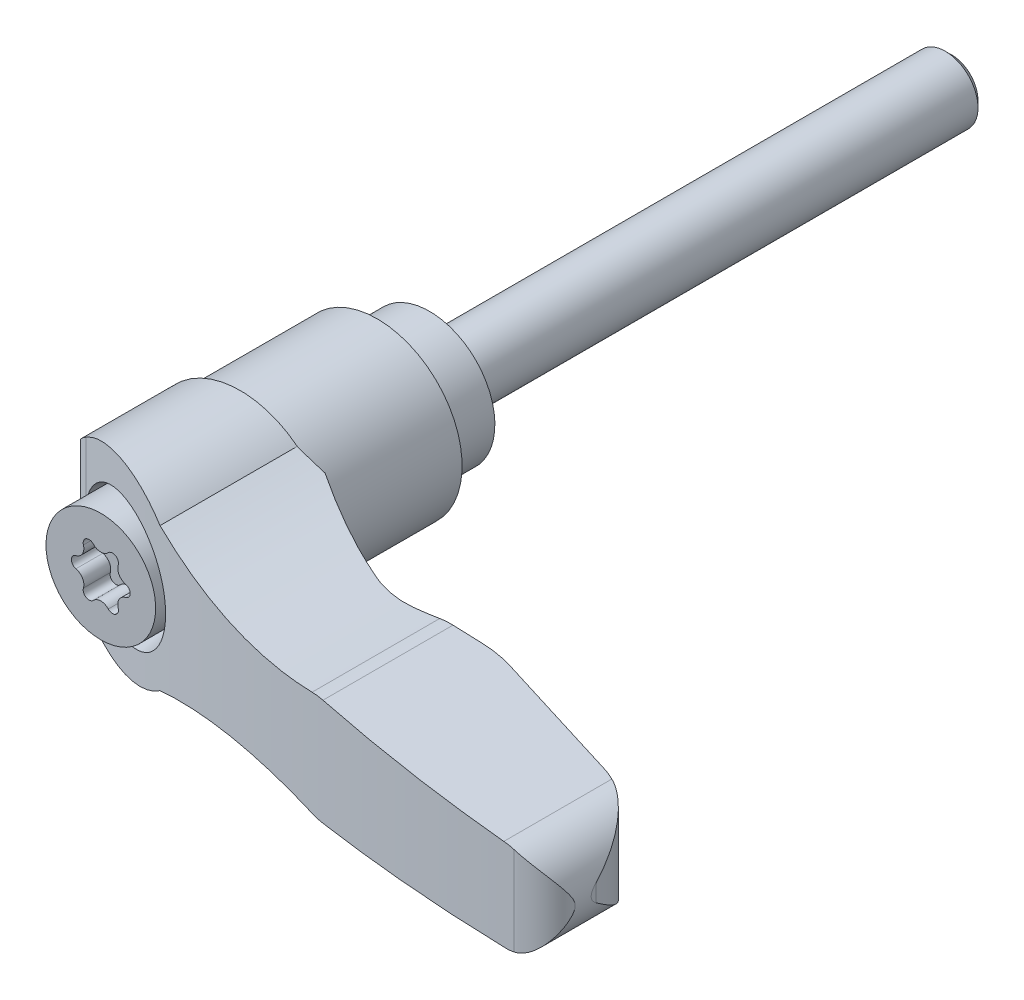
ISO-10303-21;
HEADER;
FILE_DESCRIPTION(('STEP AP214'),'2;1');
FILE_NAME('part.step','',(''),(''),'','','');
FILE_SCHEMA(('AUTOMOTIVE_DESIGN { 1 0 10303 214 1 1 1 1 }'));
ENDSEC;
DATA;
#1=APPLICATION_CONTEXT('core data for automotive mechanical design processes');
#2=APPLICATION_PROTOCOL_DEFINITION('international standard','automotive_design',2000,#1);
#3=PRODUCT_CONTEXT('',#1,'mechanical');
#4=PRODUCT('Part','Part','',(#3));
#5=PRODUCT_RELATED_PRODUCT_CATEGORY('part','',(#4));
#6=PRODUCT_DEFINITION_FORMATION('','',#4);
#7=PRODUCT_DEFINITION_CONTEXT('part definition',#1,'design');
#8=PRODUCT_DEFINITION('design','',#6,#7);
#9=PRODUCT_DEFINITION_SHAPE('','',#8);
#10=(LENGTH_UNIT() NAMED_UNIT(*) SI_UNIT(.MILLI.,.METRE.));
#11=(NAMED_UNIT(*) PLANE_ANGLE_UNIT() SI_UNIT($,.RADIAN.));
#12=(NAMED_UNIT(*) SI_UNIT($,.STERADIAN.) SOLID_ANGLE_UNIT());
#13=UNCERTAINTY_MEASURE_WITH_UNIT(LENGTH_MEASURE(1.E-05),#10,'distance_accuracy_value','');
#14=(GEOMETRIC_REPRESENTATION_CONTEXT(3) GLOBAL_UNCERTAINTY_ASSIGNED_CONTEXT((#13)) GLOBAL_UNIT_ASSIGNED_CONTEXT((#10,
#11,#12)) REPRESENTATION_CONTEXT('',''));
#15=CARTESIAN_POINT('',(0.,0.,0.));
#16=DIRECTION('',(0.,0.,1.));
#17=DIRECTION('',(1.,0.,0.));
#18=AXIS2_PLACEMENT_3D('',#15,#16,#17);
#19=CARTESIAN_POINT('',(39.938965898,-8.,27.204249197));
#20=DIRECTION('',(-0.989626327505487,0.,0.143665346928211));
#21=DIRECTION('',(-0.143665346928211,0.,-0.989626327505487));
#22=AXIS2_PLACEMENT_3D('',#19,#20,#21);
#23=PLANE('',#22);
#24=CARTESIAN_POINT('',(36.5,0.,3.51522978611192));
#25=DIRECTION('',(-0.989626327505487,0.,0.143665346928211));
#26=DIRECTION('',(0.143665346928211,0.,0.989626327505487));
#27=AXIS2_PLACEMENT_3D('',#24,#25,#26);
#28=ELLIPSE('',#27,24.3621727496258,3.5);
#29=CARTESIAN_POINT('',(39.9389658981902,-0.650779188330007,27.2042491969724));
#30=VERTEX_POINT('',#29);
#31=CARTESIAN_POINT('',(39.9389658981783,0.650779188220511,27.2042491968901));
#32=VERTEX_POINT('',#31);
#33=EDGE_CURVE('E593',#30,#32,#28,.T.);
#34=ORIENTED_EDGE('',*,*,#33,.F.);
#35=DIRECTION('',(0.,-1.,0.));
#36=VECTOR('',#35,1.);
#37=CARTESIAN_POINT('',(39.9389658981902,0.,27.2042491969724));
#38=LINE('',#37,#36);
#39=EDGE_CURVE('E614',#32,#30,#38,.T.);
#40=ORIENTED_EDGE('',*,*,#39,.F.);
#41=EDGE_LOOP('',(#34,#40));
#42=FACE_BOUND('',#41,.T.);
#43=ADVANCED_FACE('F14',(#42),#23,.F.);
#44=CARTESIAN_POINT('',(33.862660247,3.57817111,28.086354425));
#45=DIRECTION('',(0.,1.,0.));
#46=DIRECTION('',(-1.,0.,0.));
#47=AXIS2_PLACEMENT_3D('',#44,#45,#46);
#48=CYLINDRICAL_SURFACE('',#47,6.14);
#49=CARTESIAN_POINT('',(33.862660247,-3.59762871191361,28.086354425));
#50=DIRECTION('',(0.0369925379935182,-0.999315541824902,0.));
#51=DIRECTION('',(0.999315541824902,0.0369925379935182,0.));
#52=AXIS2_PLACEMENT_3D('',#49,#50,#51);
#53=ELLIPSE('',#52,6.14420545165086,6.14);
#54=CARTESIAN_POINT('',(36.5000000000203,-3.49999999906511,22.5416236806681));
#55=VERTEX_POINT('',#54);
#56=CARTESIAN_POINT('',(35.534460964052,-3.53574220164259,22.1783359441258));
#57=VERTEX_POINT('',#56);
#58=EDGE_CURVE('E615',#55,#57,#53,.F.);
#59=ORIENTED_EDGE('',*,*,#58,.T.);
#60=DIRECTION('',(0.,-1.,0.));
#61=VECTOR('',#60,1.);
#62=CARTESIAN_POINT('',(35.5344609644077,-8.,22.1783359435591));
#63=LINE('',#62,#61);
#64=CARTESIAN_POINT('',(35.534460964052,3.53574220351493,22.1783359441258));
#65=VERTEX_POINT('',#64);
#66=EDGE_CURVE('E595',#65,#57,#63,.T.);
#67=ORIENTED_EDGE('',*,*,#66,.F.);
#68=CARTESIAN_POINT('',(33.862660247,3.59762871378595,28.086354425));
#69=DIRECTION('',(0.0369925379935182,0.999315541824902,0.));
#70=DIRECTION('',(-0.999315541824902,0.0369925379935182,0.));
#71=AXIS2_PLACEMENT_3D('',#68,#69,#70);
#72=ELLIPSE('',#71,6.14420545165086,6.14);
#73=CARTESIAN_POINT('',(36.5000000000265,3.5,22.5416236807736));
#74=VERTEX_POINT('',#73);
#75=EDGE_CURVE('E278',#65,#74,#72,.F.);
#76=ORIENTED_EDGE('',*,*,#75,.T.);
#77=CARTESIAN_POINT('',(39.9389658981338,0.650779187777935,27.2042491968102));
#78=CARTESIAN_POINT('',(39.9247028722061,0.726086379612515,27.1059853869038));
#79=CARTESIAN_POINT('',(39.9079968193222,0.800887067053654,27.0076860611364));
#80=CARTESIAN_POINT('',(39.8696347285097,0.949458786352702,26.8112602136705));
#81=CARTESIAN_POINT('',(39.8479781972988,1.02322971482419,26.7131337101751));
#82=CARTESIAN_POINT('',(39.7995979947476,1.16988012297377,26.5170899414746));
#83=CARTESIAN_POINT('',(39.7728626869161,1.24275713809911,26.4191736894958));
#84=CARTESIAN_POINT('',(39.7142815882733,1.38725410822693,26.2239599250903));
#85=CARTESIAN_POINT('',(39.6824358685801,1.45887408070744,26.1266624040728));
#86=CARTESIAN_POINT('',(39.5782917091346,1.67318502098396,25.8337016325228));
#87=CARTESIAN_POINT('',(39.4979263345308,1.81366367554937,25.6391889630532));
#88=CARTESIAN_POINT('',(39.315085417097,2.08619457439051,25.2551202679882));
#89=CARTESIAN_POINT('',(39.2126344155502,2.21825596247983,25.0655590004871));
#90=CARTESIAN_POINT('',(38.95950275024,2.49877334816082,24.6523338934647));
#91=CARTESIAN_POINT('',(38.8031801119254,2.6445633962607,24.4302018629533));
#92=CARTESIAN_POINT('',(38.5417124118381,2.84488994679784,24.1082756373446));
#93=CARTESIAN_POINT('',(38.4501831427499,2.9085413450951,24.0029632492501));
#94=CARTESIAN_POINT('',(38.2579442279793,3.02861213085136,23.7967186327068));
#95=CARTESIAN_POINT('',(38.1572360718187,3.08503268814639,23.6957856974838));
#96=CARTESIAN_POINT('',(37.8892625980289,3.21757634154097,23.4457323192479));
#97=CARTESIAN_POINT('',(37.7155213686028,3.28779061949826,23.3001643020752));
#98=CARTESIAN_POINT('',(37.4396992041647,3.37286339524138,23.0946053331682));
#99=CARTESIAN_POINT('',(37.3453175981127,3.39783246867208,23.0282732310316));
#100=CARTESIAN_POINT('',(37.1517842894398,3.44019984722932,22.9003457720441));
#101=CARTESIAN_POINT('',(37.0526354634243,3.45760265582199,22.8387476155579));
#102=CARTESIAN_POINT('',(36.8781783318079,3.48029211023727,22.7372021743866));
#103=CARTESIAN_POINT('',(36.8038676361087,3.48759914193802,22.6959814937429));
#104=CARTESIAN_POINT('',(36.6533047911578,3.49745586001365,22.616512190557));
#105=CARTESIAN_POINT('',(36.5770513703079,3.50000234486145,22.5782655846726));
#106=CARTESIAN_POINT('',(36.5000000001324,3.5,22.5416236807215));
#107=B_SPLINE_CURVE_WITH_KNOTS('',3,(#77,#78,#79,#80,#81,#82,#83,#84,#85,#86,#87,#88,#89,#90,
#91,#92,#93,#94,#95,#96,#97,#98,#99,#100,#101,#102,#103,#104,#105,#106),.UNSPECIFIED.,.F.,.F.,
(4,2,2,2,2,2,2,2,2,2,2,2,2,2,4),(0.,0.373839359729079,0.747715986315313,1.1224598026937,
1.49719840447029,2.25512351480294,3.01221072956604,3.9336772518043,4.39332639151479,
4.85290107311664,5.56171222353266,5.91546494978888,6.26900683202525,6.52468766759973,
6.78054038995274),.UNSPECIFIED.);
#108=EDGE_CURVE('E1257',#32,#74,#107,.T.);
#109=ORIENTED_EDGE('',*,*,#108,.F.);
#110=ORIENTED_EDGE('',*,*,#39,.T.);
#111=CARTESIAN_POINT('',(36.5000000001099,-3.5,22.5416236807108));
#112=CARTESIAN_POINT('',(36.6061539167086,-3.50000941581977,22.5920863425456));
#113=CARTESIAN_POINT('',(36.7107657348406,-3.49517280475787,22.6456099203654));
#114=CARTESIAN_POINT('',(36.9160027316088,-3.47671082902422,22.7581011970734));
#115=CARTESIAN_POINT('',(37.0166343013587,-3.46310021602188,22.8170596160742));
#116=CARTESIAN_POINT('',(37.2123479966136,-3.42816986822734,22.9392782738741));
#117=CARTESIAN_POINT('',(37.3074768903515,-3.40693163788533,23.0024874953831));
#118=CARTESIAN_POINT('',(37.4929223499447,-3.35757592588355,23.1332068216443));
#119=CARTESIAN_POINT('',(37.583236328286,-3.32945478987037,23.2007191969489));
#120=CARTESIAN_POINT('',(37.7830795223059,-3.25850520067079,23.3587409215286));
#121=CARTESIAN_POINT('',(37.8909927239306,-3.21376078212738,23.4504360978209));
#122=CARTESIAN_POINT('',(38.0982482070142,-3.11588681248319,23.6389903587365));
#123=CARTESIAN_POINT('',(38.1975840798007,-3.06275107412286,23.7358532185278));
#124=CARTESIAN_POINT('',(38.3880468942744,-2.94917464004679,23.9343090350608));
#125=CARTESIAN_POINT('',(38.479132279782,-2.88870020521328,24.0359224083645));
#126=CARTESIAN_POINT('',(38.6526412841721,-2.76182607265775,24.2426721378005));
#127=CARTESIAN_POINT('',(38.7350674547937,-2.69542813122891,24.3478074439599));
#128=CARTESIAN_POINT('',(38.9229341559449,-2.52996933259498,24.6038856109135));
#129=CARTESIAN_POINT('',(39.0243159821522,-2.42850340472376,24.7562617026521));
#130=CARTESIAN_POINT('',(39.2111706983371,-2.21796613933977,25.0654781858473));
#131=CARTESIAN_POINT('',(39.2966363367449,-2.1088913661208,25.2223205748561));
#132=CARTESIAN_POINT('',(39.4522229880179,-1.88493092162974,25.5392893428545));
#133=CARTESIAN_POINT('',(39.5223498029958,-1.77004746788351,25.6994144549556));
#134=CARTESIAN_POINT('',(39.6478320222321,-1.53583460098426,26.0220530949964));
#135=CARTESIAN_POINT('',(39.7031929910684,-1.41650688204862,26.1845656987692));
#136=CARTESIAN_POINT('',(39.7933776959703,-1.19018579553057,26.4900634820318));
#137=CARTESIAN_POINT('',(39.8299343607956,-1.08360162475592,26.6328455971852));
#138=CARTESIAN_POINT('',(39.8923391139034,-0.868586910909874,26.9185049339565));
#139=CARTESIAN_POINT('',(39.9182264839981,-0.760164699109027,27.0613798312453));
#140=CARTESIAN_POINT('',(39.9389658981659,-0.650779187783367,27.2042491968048));
#141=B_SPLINE_CURVE_WITH_KNOTS('',3,(#111,#112,#113,#114,#115,#116,#117,#118,#119,#120,#121,
#122,#123,#124,#125,#126,#127,#128,#129,#130,#131,#132,#133,#134,#135,#136,#137,#138,#139,#140),
.UNSPECIFIED.,.F.,.F.,(4,2,2,2,2,2,2,2,2,2,2,2,2,2,4),(0.,0.352350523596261,0.704110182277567,
1.05221781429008,1.40051067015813,1.84538152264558,2.29058194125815,2.73791274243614,
3.18511135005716,3.81198117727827,4.43913591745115,5.06605301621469,5.69273352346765,
6.23807905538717,6.78139842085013),.UNSPECIFIED.);
#142=EDGE_CURVE('E586',#55,#30,#141,.T.);
#143=ORIENTED_EDGE('',*,*,#142,.F.);
#144=EDGE_LOOP('',(#59,#67,#76,#109,#110,#143));
#145=FACE_BOUND('',#144,.T.);
#146=ADVANCED_FACE('F558',(#145),#48,.T.);
#147=CARTESIAN_POINT('',(25.51080482,-8.,19.341927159));
#148=DIRECTION('',(-0.272280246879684,0.,0.962217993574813));
#149=DIRECTION('',(-0.962217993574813,0.,-0.272280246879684));
#150=AXIS2_PLACEMENT_3D('',#147,#148,#149);
#151=PLANE('',#150);
#152=DIRECTION('',(0.961608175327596,0.0355966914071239,0.272107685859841));
#153=VECTOR('',#152,1.);
#154=CARTESIAN_POINT('',(25.5108048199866,-3.90679665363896,19.341927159));
#155=LINE('',#154,#153);
#156=CARTESIAN_POINT('',(25.510804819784,-3.90679665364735,19.3419271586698));
#157=VERTEX_POINT('',#156);
#158=EDGE_CURVE('E713',#157,#57,#155,.T.);
#159=ORIENTED_EDGE('',*,*,#158,.F.);
#160=DIRECTION('',(0.,-1.,0.));
#161=VECTOR('',#160,1.);
#162=CARTESIAN_POINT('',(25.5108048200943,0.,19.3419271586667));
#163=LINE('',#162,#161);
#164=CARTESIAN_POINT('',(25.5108048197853,3.90679665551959,19.3419271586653));
#165=VERTEX_POINT('',#164);
#166=EDGE_CURVE('E532',#165,#157,#163,.T.);
#167=ORIENTED_EDGE('',*,*,#166,.F.);
#168=DIRECTION('',(-0.961608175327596,0.0355966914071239,-0.272107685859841));
#169=VECTOR('',#168,1.);
#170=CARTESIAN_POINT('',(35.5344609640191,3.53574220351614,22.178335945));
#171=LINE('',#170,#169);
#172=EDGE_CURVE('E697',#65,#165,#171,.T.);
#173=ORIENTED_EDGE('',*,*,#172,.F.);
#174=ORIENTED_EDGE('',*,*,#66,.T.);
#175=EDGE_LOOP('',(#159,#167,#173,#174));
#176=FACE_BOUND('',#175,.T.);
#177=ADVANCED_FACE('F556',(#176),#151,.F.);
#178=CARTESIAN_POINT('',(23.046668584,4.045989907,28.05));
#179=DIRECTION('',(0.,1.,0.));
#180=DIRECTION('',(-1.,0.,0.));
#181=AXIS2_PLACEMENT_3D('',#178,#179,#180);
#182=CYLINDRICAL_SURFACE('',#181,9.05);
#183=CARTESIAN_POINT('',(23.046668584,-3.99801374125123,28.05));
#184=DIRECTION('',(0.0369925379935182,-0.999315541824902,0.));
#185=DIRECTION('',(0.999315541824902,0.0369925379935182,0.));
#186=AXIS2_PLACEMENT_3D('',#183,#184,#185);
#187=ELLIPSE('',#186,9.05619858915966,9.05);
#188=CARTESIAN_POINT('',(23.046668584,-3.99801374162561,19.));
#189=VERTEX_POINT('',#188);
#190=EDGE_CURVE('E534',#189,#157,#187,.T.);
#191=ORIENTED_EDGE('',*,*,#190,.F.);
#192=DIRECTION('',(0.,-1.,0.));
#193=VECTOR('',#192,1.);
#194=CARTESIAN_POINT('',(23.046668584,-8.,19.));
#195=LINE('',#194,#193);
#196=CARTESIAN_POINT('',(23.046668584,3.99801374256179,19.));
#197=VERTEX_POINT('',#196);
#198=EDGE_CURVE('E683',#197,#189,#195,.T.);
#199=ORIENTED_EDGE('',*,*,#198,.F.);
#200=CARTESIAN_POINT('',(23.046668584,3.99801374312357,28.05));
#201=DIRECTION('',(0.0369925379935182,0.999315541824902,0.));
#202=DIRECTION('',(-0.999315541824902,0.0369925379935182,0.));
#203=AXIS2_PLACEMENT_3D('',#200,#201,#202);
#204=ELLIPSE('',#203,9.05619858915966,9.05);
#205=EDGE_CURVE('E700',#165,#197,#204,.T.);
#206=ORIENTED_EDGE('',*,*,#205,.F.);
#207=ORIENTED_EDGE('',*,*,#166,.T.);
#208=EDGE_LOOP('',(#191,#199,#206,#207));
#209=FACE_BOUND('',#208,.T.);
#210=ADVANCED_FACE('F545',(#209),#182,.T.);
#211=CARTESIAN_POINT('',(17.75042382,-3.790381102,9.95));
#212=DIRECTION('',(0.,1.,0.));
#213=DIRECTION('',(-1.,0.,0.));
#214=AXIS2_PLACEMENT_3D('',#211,#212,#213);
#215=CYLINDRICAL_SURFACE('',#214,9.05);
#216=DIRECTION('',(0.,-1.,0.));
#217=VECTOR('',#216,1.);
#218=CARTESIAN_POINT('',(14.2560355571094,0.,18.2981585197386));
#219=LINE('',#218,#217);
#220=CARTESIAN_POINT('',(14.2560355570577,3.60493202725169,18.2981585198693));
#221=VERTEX_POINT('',#220);
#222=CARTESIAN_POINT('',(14.2560355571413,-3.60493202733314,18.2981585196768));
#223=VERTEX_POINT('',#222);
#224=EDGE_CURVE('E641',#221,#223,#219,.T.);
#225=ORIENTED_EDGE('',*,*,#224,.F.);
#226=CARTESIAN_POINT('',(14.8000000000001,3.6,18.50555371));
#227=CARTESIAN_POINT('',(14.777067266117,3.59999999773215,18.497645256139));
#228=CARTESIAN_POINT('',(14.7541663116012,3.60002629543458,18.4896446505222));
#229=CARTESIAN_POINT('',(14.7084314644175,3.60013103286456,18.4734602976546));
#230=CARTESIAN_POINT('',(14.6855975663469,3.60020946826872,18.4652765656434));
#231=CARTESIAN_POINT('',(14.6399969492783,3.60041802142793,18.4487259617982));
#232=CARTESIAN_POINT('',(14.6172302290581,3.60054813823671,18.4403590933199));
#233=CARTESIAN_POINT('',(14.5717640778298,3.60085959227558,18.4234422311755));
#234=CARTESIAN_POINT('',(14.5490646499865,3.60104093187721,18.4148922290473));
#235=CARTESIAN_POINT('',(14.5037331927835,3.60145437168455,18.397609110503));
#236=CARTESIAN_POINT('',(14.4811011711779,3.60168647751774,18.3888759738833));
#237=CARTESIAN_POINT('',(14.4359046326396,3.60220099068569,18.371226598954));
#238=CARTESIAN_POINT('',(14.4133401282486,3.60248340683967,18.3623103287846));
#239=CARTESIAN_POINT('',(14.3682787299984,3.60309808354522,18.3442946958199));
#240=CARTESIAN_POINT('',(14.3457818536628,3.60343035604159,18.3351952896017));
#241=CARTESIAN_POINT('',(14.3008558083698,3.60414428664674,18.3168134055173));
#242=CARTESIAN_POINT('',(14.2784266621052,3.60452595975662,18.3075308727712));
#243=CARTESIAN_POINT('',(14.2560355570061,3.60493202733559,18.29815852));
#244=B_SPLINE_CURVE_WITH_KNOTS('',3,(#226,#227,#228,#229,#230,#231,#232,#233,#234,#235,#236,
#237,#238,#239,#240,#241,#242,#243),.UNSPECIFIED.,.F.,.F.,(4,2,2,2,2,2,2,2,4),(0.,
0.0727739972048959,0.145541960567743,0.218308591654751,0.29107859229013,0.363856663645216,
0.436647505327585,0.509455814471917,0.582286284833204),.UNSPECIFIED.);
#245=CARTESIAN_POINT('',(14.8000000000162,3.6,18.5055537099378));
#246=VERTEX_POINT('',#245);
#247=EDGE_CURVE('E394',#246,#221,#244,.T.);
#248=ORIENTED_EDGE('',*,*,#247,.F.);
#249=CARTESIAN_POINT('',(14.8000000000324,3.6,18.5055537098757));
#250=CARTESIAN_POINT('',(15.0380116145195,3.599973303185,18.5876679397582));
#251=CARTESIAN_POINT('',(15.279471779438,3.60283245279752,18.6597877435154));
#252=CARTESIAN_POINT('',(15.7656030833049,3.61457200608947,18.7831907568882));
#253=CARTESIAN_POINT('',(16.0102370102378,3.62340749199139,18.8346248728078));
#254=CARTESIAN_POINT('',(16.5026239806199,3.64734054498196,18.9170399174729));
#255=CARTESIAN_POINT('',(16.7503770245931,3.66243811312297,18.9480208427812));
#256=CARTESIAN_POINT('',(17.2489949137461,3.69906644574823,18.989594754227));
#257=CARTESIAN_POINT('',(17.4998691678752,3.72064454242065,19.0000333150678));
#258=CARTESIAN_POINT('',(17.7504238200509,3.74543587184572,19.));
#259=B_SPLINE_CURVE_WITH_KNOTS('',3,(#249,#250,#251,#252,#253,#254,#255,#256,#257,#258),
.UNSPECIFIED.,.F.,.F.,(4,2,2,2,4),(0.,0.755099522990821,1.50458591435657,2.25407243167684,
3.00917194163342),.UNSPECIFIED.);
#260=CARTESIAN_POINT('',(17.7504238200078,3.74543587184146,19.));
#261=VERTEX_POINT('',#260);
#262=EDGE_CURVE('E441',#246,#261,#259,.T.);
#263=ORIENTED_EDGE('',*,*,#262,.T.);
#264=DIRECTION('',(0.,-1.,0.));
#265=VECTOR('',#264,1.);
#266=CARTESIAN_POINT('',(17.75042382,0.,19.));
#267=LINE('',#266,#265);
#268=CARTESIAN_POINT('',(17.7504238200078,-3.74543587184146,19.));
#269=VERTEX_POINT('',#268);
#270=EDGE_CURVE('E688',#261,#269,#267,.T.);
#271=ORIENTED_EDGE('',*,*,#270,.T.);
#272=CARTESIAN_POINT('',(14.2560355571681,-3.60493202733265,18.2981585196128));
#273=CARTESIAN_POINT('',(14.4838161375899,-3.60077563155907,18.3935396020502));
#274=CARTESIAN_POINT('',(14.7155749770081,-3.59919241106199,18.4795580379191));
#275=CARTESIAN_POINT('',(15.185457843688,-3.60156277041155,18.6324166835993));
#276=CARTESIAN_POINT('',(15.4235855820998,-3.60551965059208,18.6992454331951));
#277=CARTESIAN_POINT('',(15.9002362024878,-3.61924836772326,18.8121846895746));
#278=CARTESIAN_POINT('',(16.1386829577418,-3.62891979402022,18.8586293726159));
#279=CARTESIAN_POINT('',(16.6180975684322,-3.65418161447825,18.9321530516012));
#280=CARTESIAN_POINT('',(16.859063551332,-3.66976787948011,18.9592455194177));
#281=CARTESIAN_POINT('',(17.2084780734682,-3.69663888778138,18.9844088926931));
#282=CARTESIAN_POINT('',(17.3166030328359,-3.7055440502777,18.9902441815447));
#283=CARTESIAN_POINT('',(17.5333084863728,-3.72457700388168,18.9980471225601));
#284=CARTESIAN_POINT('',(17.6418891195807,-3.7347094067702,18.9999996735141));
#285=CARTESIAN_POINT('',(17.7504238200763,-3.74543587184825,19.));
#286=B_SPLINE_CURVE_WITH_KNOTS('',3,(#272,#273,#274,#275,#276,#277,#278,#279,#280,#281,#282,
#283,#284,#285),.UNSPECIFIED.,.F.,.F.,(4,2,2,2,2,2,4),(0.,0.740736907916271,1.48191527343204,
2.21044217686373,2.93846142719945,3.26434207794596,3.59148772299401),.UNSPECIFIED.);
#287=EDGE_CURVE('E386',#223,#269,#286,.T.);
#288=ORIENTED_EDGE('',*,*,#287,.F.);
#289=EDGE_LOOP('',(#225,#248,#263,#271,#288));
#290=FACE_BOUND('',#289,.T.);
#291=ADVANCED_FACE('F413',(#290),#215,.F.);
#292=CARTESIAN_POINT('',(17.75042382,-8.,19.));
#293=DIRECTION('',(0.,0.,1.));
#294=DIRECTION('',(0.,-1.,0.));
#295=AXIS2_PLACEMENT_3D('',#292,#293,#294);
#296=PLANE('',#295);
#297=CARTESIAN_POINT('',(14.8,-33.6,19.));
#298=DIRECTION('',(0.,0.,1.));
#299=DIRECTION('',(0.,-1.,0.));
#300=AXIS2_PLACEMENT_3D('',#297,#298,#299);
#301=CIRCLE('',#300,30.);
#302=CARTESIAN_POINT('',(19.7766212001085,-4.01565884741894,19.));
#303=VERTEX_POINT('',#302);
#304=EDGE_CURVE('E667',#269,#303,#301,.F.);
#305=ORIENTED_EDGE('',*,*,#304,.F.);
#306=ORIENTED_EDGE('',*,*,#270,.F.);
#307=CARTESIAN_POINT('',(14.8,33.6,19.));
#308=DIRECTION('',(0.,0.,1.));
#309=DIRECTION('',(0.,-1.,0.));
#310=AXIS2_PLACEMENT_3D('',#307,#308,#309);
#311=CIRCLE('',#310,30.);
#312=CARTESIAN_POINT('',(19.7766212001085,4.01565884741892,19.));
#313=VERTEX_POINT('',#312);
#314=EDGE_CURVE('E687',#261,#313,#311,.T.);
#315=ORIENTED_EDGE('',*,*,#314,.T.);
#316=CARTESIAN_POINT('',(20.606058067,-0.915064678,19.));
#317=DIRECTION('',(0.,0.,1.));
#318=DIRECTION('',(0.,-1.,0.));
#319=AXIS2_PLACEMENT_3D('',#316,#317,#318);
#320=CIRCLE('',#319,5.);
#321=CARTESIAN_POINT('',(20.7910207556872,4.08151303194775,19.));
#322=VERTEX_POINT('',#321);
#323=EDGE_CURVE('E533',#322,#313,#320,.T.);
#324=ORIENTED_EDGE('',*,*,#323,.F.);
#325=DIRECTION('',(0.999315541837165,-0.0369925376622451,0.));
#326=VECTOR('',#325,1.);
#327=CARTESIAN_POINT('',(20.791020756,4.081513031,19.));
#328=LINE('',#327,#326);
#329=EDGE_CURVE('E684',#322,#197,#328,.T.);
#330=ORIENTED_EDGE('',*,*,#329,.T.);
#331=ORIENTED_EDGE('',*,*,#198,.T.);
#332=DIRECTION('',(-0.999315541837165,-0.0369925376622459,0.));
#333=VECTOR('',#332,1.);
#334=CARTESIAN_POINT('',(23.046668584,-3.998013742,19.));
#335=LINE('',#334,#333);
#336=CARTESIAN_POINT('',(20.7910207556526,-4.08151303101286,19.));
#337=VERTEX_POINT('',#336);
#338=EDGE_CURVE('E679',#189,#337,#335,.T.);
#339=ORIENTED_EDGE('',*,*,#338,.T.);
#340=CARTESIAN_POINT('',(20.606058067,0.915064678,19.));
#341=DIRECTION('',(0.,0.,1.));
#342=DIRECTION('',(-1.,0.,0.));
#343=AXIS2_PLACEMENT_3D('',#340,#341,#342);
#344=CIRCLE('',#343,5.);
#345=EDGE_CURVE('E682',#303,#337,#344,.T.);
#346=ORIENTED_EDGE('',*,*,#345,.F.);
#347=EDGE_LOOP('',(#305,#306,#315,#324,#330,#331,#339,#346));
#348=FACE_BOUND('',#347,.T.);
#349=ADVANCED_FACE('F1020',(#348),#296,.F.);
#350=CARTESIAN_POINT('',(-6.51,-8.,18.787325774));
#351=DIRECTION('',(1.,0.,0.));
#352=DIRECTION('',(0.,1.,0.));
#353=AXIS2_PLACEMENT_3D('',#350,#351,#352);
#354=PLANE('',#353);
#355=DIRECTION('',(0.,0.,1.));
#356=VECTOR('',#355,1.);
#357=CARTESIAN_POINT('',(-6.51,-2.572916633,18.787325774));
#358=LINE('',#357,#356);
#359=CARTESIAN_POINT('',(-6.51,-2.57291663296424,14.5));
#360=VERTEX_POINT('',#359);
#361=CARTESIAN_POINT('',(-6.51,-2.57291663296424,18.787325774));
#362=VERTEX_POINT('',#361);
#363=EDGE_CURVE('E373',#360,#362,#358,.T.);
#364=ORIENTED_EDGE('',*,*,#363,.T.);
#365=DIRECTION('',(0.,1.,0.));
#366=VECTOR('',#365,1.);
#367=CARTESIAN_POINT('',(-6.51,-8.,18.787325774));
#368=LINE('',#367,#366);
#369=CARTESIAN_POINT('',(-6.51,2.57291663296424,18.787325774));
#370=VERTEX_POINT('',#369);
#371=EDGE_CURVE('E376',#362,#370,#368,.T.);
#372=ORIENTED_EDGE('',*,*,#371,.T.);
#373=DIRECTION('',(0.,0.,1.));
#374=VECTOR('',#373,1.);
#375=CARTESIAN_POINT('',(-6.51,2.572916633,18.787325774));
#376=LINE('',#375,#374);
#377=CARTESIAN_POINT('',(-6.51,2.57291663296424,14.5));
#378=VERTEX_POINT('',#377);
#379=EDGE_CURVE('E377',#370,#378,#376,.F.);
#380=ORIENTED_EDGE('',*,*,#379,.T.);
#381=DIRECTION('',(0.,-1.,0.));
#382=VECTOR('',#381,1.);
#383=CARTESIAN_POINT('',(-6.51,-8.,14.5));
#384=LINE('',#383,#382);
#385=CARTESIAN_POINT('',(-6.51,0.,14.5));
#386=VERTEX_POINT('',#385);
#387=EDGE_CURVE('E365',#386,#378,#384,.F.);
#388=ORIENTED_EDGE('',*,*,#387,.F.);
#389=DIRECTION('',(0.,-1.,0.));
#390=VECTOR('',#389,1.);
#391=CARTESIAN_POINT('',(-6.51,-8.,14.5));
#392=LINE('',#391,#390);
#393=EDGE_CURVE('E361',#360,#386,#392,.F.);
#394=ORIENTED_EDGE('',*,*,#393,.F.);
#395=EDGE_LOOP('',(#364,#372,#380,#388,#394));
#396=FACE_BOUND('',#395,.T.);
#397=ADVANCED_FACE('F543',(#396),#354,.F.);
#398=CARTESIAN_POINT('',(20.606058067,-0.915064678,29.017337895));
#399=DIRECTION('',(0.,0.,1.));
#400=DIRECTION('',(0.,-1.,0.));
#401=AXIS2_PLACEMENT_3D('',#398,#399,#400);
#402=CYLINDRICAL_SURFACE('',#401,5.);
#403=CARTESIAN_POINT('',(19.7766211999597,4.01565884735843,28.7744790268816));
#404=CARTESIAN_POINT('',(19.9444912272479,4.043860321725,28.8054315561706));
#405=CARTESIAN_POINT('',(20.1129595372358,4.06344890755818,28.8361672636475));
#406=CARTESIAN_POINT('',(20.451092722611,4.08540030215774,28.8972050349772));
#407=CARTESIAN_POINT('',(20.6207575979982,4.08776311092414,28.92750709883));
#408=CARTESIAN_POINT('',(20.7910207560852,4.08151303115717,28.9575923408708));
#409=B_SPLINE_CURVE_WITH_KNOTS('',3,(#403,#404,#405,#406,#407,#408),.UNSPECIFIED.,.F.,.F.,(4,2,
4),(0.,0.51709739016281,1.03419478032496),.UNSPECIFIED.);
#410=CARTESIAN_POINT('',(19.7766211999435,4.01565884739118,28.7744790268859));
#411=VERTEX_POINT('',#410);
#412=CARTESIAN_POINT('',(20.7910207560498,4.08151303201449,28.9575923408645));
#413=VERTEX_POINT('',#412);
#414=EDGE_CURVE('E524',#411,#413,#409,.T.);
#415=ORIENTED_EDGE('',*,*,#414,.T.);
#416=DIRECTION('',(0.,0.,1.));
#417=VECTOR('',#416,1.);
#418=CARTESIAN_POINT('',(20.7910207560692,4.08151303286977,0.));
#419=LINE('',#418,#417);
#420=EDGE_CURVE('E704',#322,#413,#419,.T.);
#421=ORIENTED_EDGE('',*,*,#420,.F.);
#422=ORIENTED_EDGE('',*,*,#323,.T.);
#423=DIRECTION('',(0.,0.,-1.));
#424=VECTOR('',#423,1.);
#425=CARTESIAN_POINT('',(19.7766211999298,4.01565884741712,23.6400163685));
#426=LINE('',#425,#424);
#427=EDGE_CURVE('E693',#411,#313,#426,.T.);
#428=ORIENTED_EDGE('',*,*,#427,.F.);
#429=EDGE_LOOP('',(#415,#421,#422,#428));
#430=FACE_BOUND('',#429,.T.);
#431=ADVANCED_FACE('F537',(#430),#402,.T.);
#432=CARTESIAN_POINT('',(36.5,3.5,0.));
#433=DIRECTION('',(0.0369925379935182,0.999315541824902,0.));
#434=DIRECTION('',(-0.999315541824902,0.0369925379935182,0.));
#435=AXIS2_PLACEMENT_3D('',#432,#433,#434);
#436=PLANE('',#435);
#437=ORIENTED_EDGE('',*,*,#172,.T.);
#438=ORIENTED_EDGE('',*,*,#205,.T.);
#439=ORIENTED_EDGE('',*,*,#329,.F.);
#440=ORIENTED_EDGE('',*,*,#420,.T.);
#441=CARTESIAN_POINT('',(44.887195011,3.18952386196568,-107.430179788));
#442=DIRECTION('',(0.0369925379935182,0.999315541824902,0.));
#443=DIRECTION('',(-0.999315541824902,0.0369925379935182,0.));
#444=AXIS2_PLACEMENT_3D('',#441,#442,#443);
#445=ELLIPSE('',#444,138.594862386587,138.5);
#446=CARTESIAN_POINT('',(36.5000000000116,3.5,30.8156337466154));
#447=VERTEX_POINT('',#446);
#448=EDGE_CURVE('E612',#447,#413,#445,.F.);
#449=ORIENTED_EDGE('',*,*,#448,.F.);
#450=DIRECTION('',(0.,0.,1.));
#451=VECTOR('',#450,1.);
#452=CARTESIAN_POINT('',(36.5,3.5,0.));
#453=LINE('',#452,#451);
#454=EDGE_CURVE('E701',#447,#74,#453,.F.);
#455=ORIENTED_EDGE('',*,*,#454,.T.);
#456=ORIENTED_EDGE('',*,*,#75,.F.);
#457=EDGE_LOOP('',(#437,#438,#439,#440,#449,#455,#456));
#458=FACE_BOUND('',#457,.T.);
#459=ADVANCED_FACE('F542',(#458),#436,.T.);
#460=CARTESIAN_POINT('',(37.465998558,3.442435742,28.267041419));
#461=DIRECTION('',(0.,1.,0.));
#462=DIRECTION('',(0.,0.,1.));
#463=AXIS2_PLACEMENT_3D('',#460,#461,#462);
#464=CYLINDRICAL_SURFACE('',#463,2.6);
#465=CARTESIAN_POINT('',(37.3240185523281,-3.4016162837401,30.8631619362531));
#466=CARTESIAN_POINT('',(37.3919716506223,-3.3851732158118,30.8668922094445));
#467=CARTESIAN_POINT('',(37.4595368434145,-3.36663314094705,30.8678982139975));
#468=CARTESIAN_POINT('',(37.5932558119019,-3.32560433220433,30.8647814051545));
#469=CARTESIAN_POINT('',(37.6594111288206,-3.30312018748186,30.8606645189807));
#470=CARTESIAN_POINT('',(37.7892422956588,-3.25463069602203,30.8476879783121));
#471=CARTESIAN_POINT('',(37.8529352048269,-3.22865917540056,30.8388717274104));
#472=CARTESIAN_POINT('',(37.9780610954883,-3.17332957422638,30.8169100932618));
#473=CARTESIAN_POINT('',(38.0394934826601,-3.14397061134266,30.8037635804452));
#474=CARTESIAN_POINT('',(38.2193407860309,-3.05154761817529,30.7585649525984));
#475=CARTESIAN_POINT('',(38.3339863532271,-2.98387977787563,30.720678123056));
#476=CARTESIAN_POINT('',(38.5517469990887,-2.83858332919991,30.6324206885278));
#477=CARTESIAN_POINT('',(38.65483454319,-2.76093184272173,30.5820211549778));
#478=CARTESIAN_POINT('',(38.8266240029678,-2.61655566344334,30.4842689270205));
#479=CARTESIAN_POINT('',(38.8977928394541,-2.55140349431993,30.4388636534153));
#480=CARTESIAN_POINT('',(39.033032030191,-2.41719450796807,30.3433990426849));
#481=CARTESIAN_POINT('',(39.0970987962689,-2.34813574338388,30.2933373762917));
#482=CARTESIAN_POINT('',(39.2184583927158,-2.20651593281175,30.1893555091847));
#483=CARTESIAN_POINT('',(39.2757267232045,-2.13394347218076,30.1354224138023));
#484=CARTESIAN_POINT('',(39.3834202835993,-1.98601467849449,30.0247262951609));
#485=CARTESIAN_POINT('',(39.4338477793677,-1.91065927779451,29.9679642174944));
#486=CARTESIAN_POINT('',(39.5424216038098,-1.73419390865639,29.834814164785));
#487=CARTESIAN_POINT('',(39.5982636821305,-1.63221026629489,29.7576994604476));
#488=CARTESIAN_POINT('',(39.6992507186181,-1.42414580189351,29.6016725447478));
#489=CARTESIAN_POINT('',(39.7443778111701,-1.31805847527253,29.5227575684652));
#490=CARTESIAN_POINT('',(39.8239748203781,-1.10201250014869,29.3659395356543));
#491=CARTESIAN_POINT('',(39.8584945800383,-0.992074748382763,29.2880334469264));
#492=CARTESIAN_POINT('',(39.9024721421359,-0.822532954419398,29.175465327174));
#493=CARTESIAN_POINT('',(39.915818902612,-0.765322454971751,29.1387019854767));
#494=CARTESIAN_POINT('',(39.9398687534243,-0.648730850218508,29.0678854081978));
#495=CARTESIAN_POINT('',(39.9505741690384,-0.589351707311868,29.0338298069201));
#496=CARTESIAN_POINT('',(39.9677207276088,-0.477086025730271,28.9756717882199));
#497=CARTESIAN_POINT('',(39.9745675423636,-0.424644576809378,28.9508462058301));
#498=CARTESIAN_POINT('',(39.9860225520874,-0.31710041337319,28.907341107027));
#499=CARTESIAN_POINT('',(39.9906385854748,-0.262007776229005,28.8886401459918));
#500=CARTESIAN_POINT('',(39.9966233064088,-0.160246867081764,28.8637621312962));
#501=CARTESIAN_POINT('',(39.9984523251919,-0.114054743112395,28.855844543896));
#502=CARTESIAN_POINT('',(40.000245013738,-0.0209844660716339,28.8480882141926));
#503=CARTESIAN_POINT('',(40.0002117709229,0.0258924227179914,28.8482361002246));
#504=CARTESIAN_POINT('',(39.9982952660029,0.118673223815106,28.8565205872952));
#505=CARTESIAN_POINT('',(39.9964185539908,0.164579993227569,28.8646289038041));
#506=CARTESIAN_POINT('',(39.9910077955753,0.254792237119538,28.8870890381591));
#507=CARTESIAN_POINT('',(39.9874686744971,0.299092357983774,28.9014599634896));
#508=CARTESIAN_POINT('',(39.9768286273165,0.407331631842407,28.9425913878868));
#509=CARTESIAN_POINT('',(39.9688318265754,0.470155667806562,28.9719648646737));
#510=CARTESIAN_POINT('',(39.9499913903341,0.592804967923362,29.0357412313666));
#511=CARTESIAN_POINT('',(39.9391402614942,0.652621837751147,29.0701572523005));
#512=CARTESIAN_POINT('',(39.91466791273,0.770513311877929,29.1419530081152));
#513=CARTESIAN_POINT('',(39.9010254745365,0.828570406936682,29.1793540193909));
#514=CARTESIAN_POINT('',(39.8711028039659,0.942948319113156,29.2555524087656));
#515=CARTESIAN_POINT('',(39.8548254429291,0.999270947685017,29.2943482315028));
#516=CARTESIAN_POINT('',(39.8016737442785,1.16743052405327,29.412513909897));
#517=CARTESIAN_POINT('',(39.7607263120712,1.27728998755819,29.492903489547));
#518=CARTESIAN_POINT('',(39.6677863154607,1.49294923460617,29.6529504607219));
#519=CARTESIAN_POINT('',(39.6157831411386,1.59874500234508,29.7326070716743));
#520=CARTESIAN_POINT('',(39.5005962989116,1.80564964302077,29.88869859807));
#521=CARTESIAN_POINT('',(39.4374682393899,1.90677880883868,29.9651472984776));
#522=CARTESIAN_POINT('',(39.2994322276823,2.10420274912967,30.1133269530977));
#523=CARTESIAN_POINT('',(39.2245345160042,2.20050163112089,30.185061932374));
#524=CARTESIAN_POINT('',(39.0442948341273,2.40820773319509,30.3372680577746));
#525=CARTESIAN_POINT('',(38.9358888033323,2.51819132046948,30.4161167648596));
#526=CARTESIAN_POINT('',(38.7000548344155,2.72661817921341,30.5596631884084));
#527=CARTESIAN_POINT('',(38.5726396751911,2.82506912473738,30.6243703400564));
#528=CARTESIAN_POINT('',(38.3254287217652,2.98922551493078,30.7237897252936));
#529=CARTESIAN_POINT('',(38.2087727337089,3.05759991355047,30.7618634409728));
#530=CARTESIAN_POINT('',(37.9650868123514,3.18151991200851,30.821751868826));
#531=CARTESIAN_POINT('',(37.8380866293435,3.23710065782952,30.8436115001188));
#532=CARTESIAN_POINT('',(37.6449758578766,3.30809571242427,30.8616375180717));
#533=CARTESIAN_POINT('',(37.5816155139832,3.32934967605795,30.86525651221));
#534=CARTESIAN_POINT('',(37.4536356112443,3.36824338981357,30.8678010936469));
#535=CARTESIAN_POINT('',(37.3890148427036,3.38587945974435,30.8667219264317));
#536=CARTESIAN_POINT('',(37.3240179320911,3.40161644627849,30.8631618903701));
#537=B_SPLINE_CURVE_WITH_KNOTS('',3,(#465,#466,#467,#468,#469,#470,#471,#472,#473,#474,#475,
#476,#477,#478,#479,#480,#481,#482,#483,#484,#485,#486,#487,#488,#489,#490,#491,#492,#493,#494,
#495,#496,#497,#498,#499,#500,#501,#502,#503,#504,#505,#506,#507,#508,#509,#510,#511,#512,#513,
#514,#515,#516,#517,#518,#519,#520,#521,#522,#523,#524,#525,#526,#527,#528,#529,#530,#531,#532,
#533,#534,#535,#536),.UNSPECIFIED.,.F.,.F.,(4,2,2,2,2,2,2,2,2,2,2,2,2,2,2,2,2,2,2,2,2,2,2,2,2,2,
2,2,2,2,2,2,2,2,2,4),(0.,0.209913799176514,0.419584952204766,0.627352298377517,
0.835173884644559,1.24864934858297,1.66308979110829,1.98257901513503,2.3022289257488,
2.6229978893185,2.94366034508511,3.36167083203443,3.78037346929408,4.19707746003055,
4.40489964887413,4.61253822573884,4.78756401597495,4.96197025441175,5.1020492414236,
5.24189600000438,5.38124765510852,5.52102748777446,5.72989315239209,5.93931271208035,
6.15038763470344,6.36123407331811,6.78715817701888,7.21349288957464,7.63775405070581,
8.06164809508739,8.58013054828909,9.09826600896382,9.51811083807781,9.93678814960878,
10.1373306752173,10.3380761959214),.UNSPECIFIED.);
#538=CARTESIAN_POINT('',(37.3240185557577,-3.40161629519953,30.863161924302));
#539=VERTEX_POINT('',#538);
#540=CARTESIAN_POINT('',(37.3240179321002,3.40161644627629,30.8631618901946));
#541=VERTEX_POINT('',#540);
#542=EDGE_CURVE('E579',#539,#541,#537,.T.);
#543=ORIENTED_EDGE('',*,*,#542,.T.);
#544=DIRECTION('',(0.,1.,0.));
#545=VECTOR('',#544,1.);
#546=CARTESIAN_POINT('',(37.3240183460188,0.0168771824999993,30.8631619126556));
#547=LINE('',#546,#545);
#548=EDGE_CURVE('E609',#539,#541,#547,.T.);
#549=ORIENTED_EDGE('',*,*,#548,.F.);
#550=EDGE_LOOP('',(#543,#549));
#551=FACE_BOUND('',#550,.T.);
#552=ADVANCED_FACE('F565',(#551),#464,.T.);
#553=CARTESIAN_POINT('',(36.5,0.,30.927880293));
#554=DIRECTION('',(0.,0.,1.));
#555=DIRECTION('',(0.,-1.,0.));
#556=AXIS2_PLACEMENT_3D('',#553,#554,#555);
#557=CYLINDRICAL_SURFACE('',#556,3.5);
#558=ORIENTED_EDGE('',*,*,#142,.T.);
#559=ORIENTED_EDGE('',*,*,#33,.T.);
#560=ORIENTED_EDGE('',*,*,#108,.T.);
#561=ORIENTED_EDGE('',*,*,#454,.F.);
#562=CARTESIAN_POINT('',(36.5000000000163,3.49999999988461,30.8156337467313));
#563=CARTESIAN_POINT('',(36.6392574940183,3.49994551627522,30.8240764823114));
#564=CARTESIAN_POINT('',(36.7775544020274,3.49171964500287,30.8322585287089));
#565=CARTESIAN_POINT('',(37.0522270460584,3.45892512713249,30.8481012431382));
#566=CARTESIAN_POINT('',(37.1886027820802,3.43435648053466,30.85576191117));
#567=CARTESIAN_POINT('',(37.3240179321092,3.4016164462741,30.8631618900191));
#568=B_SPLINE_CURVE_WITH_KNOTS('',3,(#562,#563,#564,#565,#566,#567),.UNSPECIFIED.,.F.,.F.,(4,2,
4),(0.,0.416348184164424,0.832696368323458),.UNSPECIFIED.);
#569=EDGE_CURVE('E571',#447,#541,#568,.T.);
#570=ORIENTED_EDGE('',*,*,#569,.T.);
#571=ORIENTED_EDGE('',*,*,#542,.F.);
#572=CARTESIAN_POINT('',(37.3240185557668,-3.40161629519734,30.8631619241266));
#573=CARTESIAN_POINT('',(37.1886032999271,-3.4343563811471,30.8557619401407));
#574=CARTESIAN_POINT('',(37.052227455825,-3.45892506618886,30.8481012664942));
#575=CARTESIAN_POINT('',(36.777554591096,-3.49171963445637,30.83225853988));
#576=CARTESIAN_POINT('',(36.6392575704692,-3.49994551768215,30.8240764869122));
#577=CARTESIAN_POINT('',(36.4999999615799,-3.5,30.8156337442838));
#578=B_SPLINE_CURVE_WITH_KNOTS('',3,(#572,#573,#574,#575,#576,#577),.UNSPECIFIED.,.F.,.F.,(4,2,
4),(0.,0.416348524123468,0.83269704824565),.UNSPECIFIED.);
#579=CARTESIAN_POINT('',(36.4999999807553,-3.49999999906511,30.8156337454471));
#580=VERTEX_POINT('',#579);
#581=EDGE_CURVE('E461',#539,#580,#578,.T.);
#582=ORIENTED_EDGE('',*,*,#581,.T.);
#583=DIRECTION('',(0.,0.,1.));
#584=VECTOR('',#583,1.);
#585=CARTESIAN_POINT('',(36.4999999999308,-3.49999999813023,0.));
#586=LINE('',#585,#584);
#587=EDGE_CURVE('E710',#55,#580,#586,.T.);
#588=ORIENTED_EDGE('',*,*,#587,.F.);
#589=EDGE_LOOP('',(#558,#559,#560,#561,#570,#571,#582,#588));
#590=FACE_BOUND('',#589,.T.);
#591=ADVANCED_FACE('F560',(#590),#557,.T.);
#592=CARTESIAN_POINT('',(20.791020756,-4.081513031,0.));
#593=DIRECTION('',(0.0369925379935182,-0.999315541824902,0.));
#594=DIRECTION('',(0.999315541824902,0.0369925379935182,0.));
#595=AXIS2_PLACEMENT_3D('',#592,#593,#594);
#596=PLANE('',#595);
#597=CARTESIAN_POINT('',(44.887195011,-3.18952386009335,-107.430179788));
#598=DIRECTION('',(0.0369925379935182,-0.999315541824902,0.));
#599=DIRECTION('',(0.999315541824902,0.0369925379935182,0.));
#600=AXIS2_PLACEMENT_3D('',#597,#598,#599);
#601=ELLIPSE('',#600,138.594862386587,138.5);
#602=CARTESIAN_POINT('',(20.7910207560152,-4.0815130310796,28.9575923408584));
#603=VERTEX_POINT('',#602);
#604=EDGE_CURVE('E613',#603,#580,#601,.F.);
#605=ORIENTED_EDGE('',*,*,#604,.F.);
#606=DIRECTION('',(0.,0.,1.));
#607=VECTOR('',#606,1.);
#608=CARTESIAN_POINT('',(20.791020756,-4.081513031,0.));
#609=LINE('',#608,#607);
#610=EDGE_CURVE('E707',#603,#337,#609,.F.);
#611=ORIENTED_EDGE('',*,*,#610,.T.);
#612=ORIENTED_EDGE('',*,*,#338,.F.);
#613=ORIENTED_EDGE('',*,*,#190,.T.);
#614=ORIENTED_EDGE('',*,*,#158,.T.);
#615=ORIENTED_EDGE('',*,*,#58,.F.);
#616=ORIENTED_EDGE('',*,*,#587,.T.);
#617=EDGE_LOOP('',(#605,#611,#612,#613,#614,#615,#616));
#618=FACE_BOUND('',#617,.T.);
#619=ADVANCED_FACE('F564',(#618),#596,.T.);
#620=CARTESIAN_POINT('',(20.606058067,0.915064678,28.984333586));
#621=DIRECTION('',(0.,0.,1.));
#622=DIRECTION('',(-1.,0.,0.));
#623=AXIS2_PLACEMENT_3D('',#620,#621,#622);
#624=CYLINDRICAL_SURFACE('',#623,5.);
#625=CARTESIAN_POINT('',(19.7766211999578,-4.01565884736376,28.774479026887));
#626=CARTESIAN_POINT('',(19.9138057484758,-4.03875392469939,28.7997727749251));
#627=CARTESIAN_POINT('',(20.0519904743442,-4.0560951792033,28.825031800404));
#628=CARTESIAN_POINT('',(20.3288017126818,-4.07916061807,28.8751936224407));
#629=CARTESIAN_POINT('',(20.4674240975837,-4.08493209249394,28.9000974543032));
#630=CARTESIAN_POINT('',(20.6677243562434,-4.08493675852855,28.9357661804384));
#631=CARTESIAN_POINT('',(20.7293929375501,-4.08379689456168,28.9467046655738));
#632=CARTESIAN_POINT('',(20.7910207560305,-4.0815130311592,28.9575923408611));
#633=B_SPLINE_CURVE_WITH_KNOTS('',3,(#625,#626,#627,#628,#629,#630,#631,#632),.UNSPECIFIED.,.F.,
.F.,(4,2,2,4),(0.,0.424118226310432,0.846499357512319,1.03438027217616),.UNSPECIFIED.);
#634=CARTESIAN_POINT('',(19.7766211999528,-4.01565884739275,28.7744790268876));
#635=VERTEX_POINT('',#634);
#636=EDGE_CURVE('E494',#635,#603,#633,.T.);
#637=ORIENTED_EDGE('',*,*,#636,.F.);
#638=DIRECTION('',(0.,0.,1.));
#639=VECTOR('',#638,1.);
#640=CARTESIAN_POINT('',(19.7766211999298,-4.01565884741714,21.6800629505));
#641=LINE('',#640,#639);
#642=EDGE_CURVE('E669',#303,#635,#641,.T.);
#643=ORIENTED_EDGE('',*,*,#642,.F.);
#644=ORIENTED_EDGE('',*,*,#345,.T.);
#645=ORIENTED_EDGE('',*,*,#610,.F.);
#646=EDGE_LOOP('',(#637,#643,#644,#645));
#647=FACE_BOUND('',#646,.T.);
#648=ADVANCED_FACE('F455',(#647),#624,.T.);
#649=CARTESIAN_POINT('',(14.8,-33.6,14.5));
#650=DIRECTION('',(0.,0.,1.));
#651=DIRECTION('',(0.,-1.,0.));
#652=AXIS2_PLACEMENT_3D('',#649,#650,#651);
#653=CYLINDRICAL_SURFACE('',#652,30.);
#654=CARTESIAN_POINT('',(19.7766211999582,-4.01565884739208,28.7744790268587));
#655=CARTESIAN_POINT('',(19.3473713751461,-3.94344458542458,28.6953483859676));
#656=CARTESIAN_POINT('',(18.9169724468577,-3.88065685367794,28.6138969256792));
#657=CARTESIAN_POINT('',(18.0547316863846,-3.773915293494,28.4464605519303));
#658=CARTESIAN_POINT('',(17.6228898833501,-3.72996108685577,28.3604757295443));
#659=CARTESIAN_POINT('',(16.7585833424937,-3.66086307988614,28.1840739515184));
#660=CARTESIAN_POINT('',(16.3261185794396,-3.635720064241,28.0936568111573));
#661=CARTESIAN_POINT('',(15.4614522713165,-3.60417208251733,27.9085480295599));
#662=CARTESIAN_POINT('',(15.029250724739,-3.59776700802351,27.8138564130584));
#663=CARTESIAN_POINT('',(13.752459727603,-3.60639161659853,27.5276931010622));
#664=CARTESIAN_POINT('',(12.9092169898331,-3.64781429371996,27.3303608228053));
#665=CARTESIAN_POINT('',(11.2329481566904,-3.8009343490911,26.9215443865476));
#666=CARTESIAN_POINT('',(10.399918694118,-3.91260789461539,26.7100650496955));
#667=CARTESIAN_POINT('',(9.13180517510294,-4.13690386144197,26.3756957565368));
#668=CARTESIAN_POINT('',(8.69112239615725,-4.22512684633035,26.2571448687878));
#669=CARTESIAN_POINT('',(7.81506054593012,-4.42103506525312,26.0168621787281));
#670=CARTESIAN_POINT('',(7.37968035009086,-4.52871609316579,25.8951310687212));
#671=CARTESIAN_POINT('',(6.50993179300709,-4.76460259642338,25.6474006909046));
#672=CARTESIAN_POINT('',(6.07563348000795,-4.89303122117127,25.5213683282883));
#673=CARTESIAN_POINT('',(5.21387075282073,-5.16919016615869,25.266766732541));
#674=CARTESIAN_POINT('',(4.78640768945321,-5.31692425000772,25.1381970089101));
#675=CARTESIAN_POINT('',(4.36278582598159,-5.47413005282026,25.0085693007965));
#676=B_SPLINE_CURVE_WITH_KNOTS('',3,(#654,#655,#656,#657,#658,#659,#660,#661,#662,#663,#664,
#665,#666,#667,#668,#669,#670,#671,#672,#673,#674,#675),.UNSPECIFIED.,.F.,.F.,(4,2,2,2,2,2,2,2,
2,2,4),(0.,1.32712609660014,2.65422554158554,3.9813803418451,5.30852746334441,7.9062998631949,
10.5031914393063,11.8972057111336,13.29091900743,14.7007650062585,16.1108862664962),.UNSPECIFIED.);
#677=CARTESIAN_POINT('',(4.36278582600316,-5.47413005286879,25.0085693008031));
#678=VERTEX_POINT('',#677);
#679=EDGE_CURVE('E382',#635,#678,#676,.T.);
#680=ORIENTED_EDGE('',*,*,#679,.T.);
#681=DIRECTION('',(0.,0.,1.));
#682=VECTOR('',#681,1.);
#683=CARTESIAN_POINT('',(4.36278582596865,-5.47413005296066,19.7858103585));
#684=LINE('',#683,#682);
#685=CARTESIAN_POINT('',(4.36278582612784,-5.47413005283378,14.5));
#686=VERTEX_POINT('',#685);
#687=EDGE_CURVE('E378',#686,#678,#684,.T.);
#688=ORIENTED_EDGE('',*,*,#687,.F.);
#689=CARTESIAN_POINT('',(14.8,-33.6,14.5));
#690=DIRECTION('',(0.,0.,1.));
#691=DIRECTION('',(0.,-1.,0.));
#692=AXIS2_PLACEMENT_3D('',#689,#690,#691);
#693=CIRCLE('',#692,30.);
#694=CARTESIAN_POINT('',(6.49000000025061,-4.77390244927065,14.500000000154));
#695=VERTEX_POINT('',#694);
#696=EDGE_CURVE('E629',#695,#686,#693,.T.);
#697=ORIENTED_EDGE('',*,*,#696,.F.);
#698=CARTESIAN_POINT('',(14.2560355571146,-3.60493202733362,18.2981585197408));
#699=CARTESIAN_POINT('',(13.9191209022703,-3.6110421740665,18.1571345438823));
#700=CARTESIAN_POINT('',(13.5833701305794,-3.62280963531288,18.0136612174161));
#701=CARTESIAN_POINT('',(12.9145226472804,-3.65743626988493,17.721986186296));
#702=CARTESIAN_POINT('',(12.5814258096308,-3.680294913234,17.5737847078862));
#703=CARTESIAN_POINT('',(11.5893580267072,-3.76493603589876,17.1235938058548));
#704=CARTESIAN_POINT('',(10.934759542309,-3.84283944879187,16.8148240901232));
#705=CARTESIAN_POINT('',(9.64003521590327,-4.03983028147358,16.1808788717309));
#706=CARTESIAN_POINT('',(8.99990836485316,-4.15891482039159,15.8557045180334));
#707=CARTESIAN_POINT('',(7.73340291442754,-4.43691869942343,15.1892512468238));
#708=CARTESIAN_POINT('',(7.10709183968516,-4.59600017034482,14.84791148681));
#709=CARTESIAN_POINT('',(6.49000000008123,-4.77390244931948,14.5000000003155));
#710=B_SPLINE_CURVE_WITH_KNOTS('',3,(#698,#699,#700,#701,#702,#703,#704,#705,#706,#707,#708,
#709),.UNSPECIFIED.,.F.,.F.,(4,2,2,2,2,4),(0.,1.09575278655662,2.19145321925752,
4.37360080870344,6.55559577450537,8.74658240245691),.UNSPECIFIED.);
#711=EDGE_CURVE('E636',#223,#695,#710,.T.);
#712=ORIENTED_EDGE('',*,*,#711,.F.);
#713=ORIENTED_EDGE('',*,*,#287,.T.);
#714=ORIENTED_EDGE('',*,*,#304,.T.);
#715=ORIENTED_EDGE('',*,*,#642,.T.);
#716=EDGE_LOOP('',(#680,#688,#697,#712,#713,#714,#715));
#717=FACE_BOUND('',#716,.T.);
#718=ADVANCED_FACE('F654',(#717),#653,.F.);
#719=CARTESIAN_POINT('',(0.,0.,23.64877144));
#720=DIRECTION('',(0.,0.,1.));
#721=DIRECTION('',(0.,-1.,0.));
#722=AXIS2_PLACEMENT_3D('',#719,#720,#721);
#723=CYLINDRICAL_SURFACE('',#722,7.);
#724=CARTESIAN_POINT('',(-4.25177912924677,-5.56078899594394,22.059631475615));
#725=CARTESIAN_POINT('',(-4.36476313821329,-5.47441687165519,22.0167280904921));
#726=CARTESIAN_POINT('',(-4.47379042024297,-5.38558471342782,21.9686892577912));
#727=CARTESIAN_POINT('',(-4.68369956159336,-5.20405066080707,21.863450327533));
#728=CARTESIAN_POINT('',(-4.78459004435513,-5.1113530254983,21.8062601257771));
#729=CARTESIAN_POINT('',(-4.97854216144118,-4.92265164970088,21.6835381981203));
#730=CARTESIAN_POINT('',(-5.07157810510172,-4.8266384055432,21.6179807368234));
#731=CARTESIAN_POINT('',(-5.24953177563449,-4.63246783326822,21.4793924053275));
#732=CARTESIAN_POINT('',(-5.33444739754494,-4.53430995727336,21.4063596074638));
#733=CARTESIAN_POINT('',(-5.49881653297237,-4.33363283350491,21.250860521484));
#734=CARTESIAN_POINT('',(-5.57800679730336,-4.23107480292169,21.1681664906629));
#735=CARTESIAN_POINT('',(-5.72790741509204,-4.02581951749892,20.9955057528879));
#736=CARTESIAN_POINT('',(-5.79861539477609,-3.92312223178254,20.905537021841));
#737=CARTESIAN_POINT('',(-5.93139868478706,-3.71930995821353,20.7182797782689));
#738=CARTESIAN_POINT('',(-5.99349204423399,-3.61819206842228,20.62100724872));
#739=CARTESIAN_POINT('',(-6.10902854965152,-3.41949188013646,20.4181707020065));
#740=CARTESIAN_POINT('',(-6.16247946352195,-3.32190646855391,20.3126142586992));
#741=CARTESIAN_POINT('',(-6.25018425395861,-3.15314153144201,20.1141368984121));
#742=CARTESIAN_POINT('',(-6.28612551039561,-3.0806584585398,20.0230811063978));
#743=CARTESIAN_POINT('',(-6.35162759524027,-2.94322703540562,19.8330927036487));
#744=CARTESIAN_POINT('',(-6.38118870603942,-2.87827835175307,19.7341604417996));
#745=CARTESIAN_POINT('',(-6.42726125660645,-2.77360438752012,19.5485449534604));
#746=CARTESIAN_POINT('',(-6.44520881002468,-2.73144441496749,19.4636227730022));
#747=CARTESIAN_POINT('',(-6.47515989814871,-2.6596660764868,19.2878517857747));
#748=CARTESIAN_POINT('',(-6.48719364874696,-2.62998407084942,19.1970358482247));
#749=CARTESIAN_POINT('',(-6.50033737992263,-2.59726423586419,19.0523354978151));
#750=CARTESIAN_POINT('',(-6.50392554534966,-2.58824743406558,19.0000194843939));
#751=CARTESIAN_POINT('',(-6.50877279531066,-2.57602226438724,18.8942731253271));
#752=CARTESIAN_POINT('',(-6.5100167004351,-2.57285175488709,18.8408377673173));
#753=CARTESIAN_POINT('',(-6.51,-2.57291663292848,18.787325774));
#754=B_SPLINE_CURVE_WITH_KNOTS('',3,(#724,#725,#726,#727,#728,#729,#730,#731,#732,#733,#734,
#735,#736,#737,#738,#739,#740,#741,#742,#743,#744,#745,#746,#747,#748,#749,#750,#751,#752,#753),
.UNSPECIFIED.,.F.,.F.,(4,2,2,2,2,2,2,2,2,2,2,2,2,2,4),(0.,0.445340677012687,0.890203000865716,
1.33646814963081,1.78284866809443,2.24357507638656,2.70443012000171,3.16430451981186,
3.62376325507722,3.98874272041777,4.35370602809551,4.64239659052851,4.92959637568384,
5.08886738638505,5.24916620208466),.UNSPECIFIED.);
#755=CARTESIAN_POINT('',(-4.25177913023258,-5.56078900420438,22.0596314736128));
#756=VERTEX_POINT('',#755);
#757=EDGE_CURVE('E389',#756,#362,#754,.T.);
#758=ORIENTED_EDGE('',*,*,#757,.T.);
#759=ORIENTED_EDGE('',*,*,#363,.F.);
#760=CARTESIAN_POINT('',(0.,0.,14.5));
#761=DIRECTION('',(0.,0.,1.));
#762=DIRECTION('',(0.,-1.,0.));
#763=AXIS2_PLACEMENT_3D('',#760,#761,#762);
#764=CIRCLE('',#763,7.);
#765=EDGE_CURVE('E364',#686,#360,#764,.F.);
#766=ORIENTED_EDGE('',*,*,#765,.F.);
#767=ORIENTED_EDGE('',*,*,#687,.T.);
#768=CARTESIAN_POINT('',(4.36278582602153,-5.47413005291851,25.0085693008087));
#769=CARTESIAN_POINT('',(4.20274892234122,-5.60170479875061,24.959603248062));
#770=CARTESIAN_POINT('',(4.03747126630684,-5.72192414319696,24.9087105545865));
#771=CARTESIAN_POINT('',(3.69789268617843,-5.94701516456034,24.8034118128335));
#772=CARTESIAN_POINT('',(3.52359402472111,-6.05189066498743,24.7490066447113));
#773=CARTESIAN_POINT('',(3.16780079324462,-6.24547635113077,24.6371397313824));
#774=CARTESIAN_POINT('',(2.98632553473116,-6.3342267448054,24.5796860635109));
#775=CARTESIAN_POINT('',(2.61717495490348,-6.49545689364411,24.4619463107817));
#776=CARTESIAN_POINT('',(2.42949954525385,-6.5679364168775,24.401660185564));
#777=CARTESIAN_POINT('',(2.05843784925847,-6.69322909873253,24.2815650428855));
#778=CARTESIAN_POINT('',(1.87527577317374,-6.74681709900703,24.2218711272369));
#779=CARTESIAN_POINT('',(1.50577163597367,-6.83878257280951,24.1005771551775));
#780=CARTESIAN_POINT('',(1.31942861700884,-6.87715537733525,24.038976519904));
#781=CARTESIAN_POINT('',(0.757327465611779,-6.96924901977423,23.8518072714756));
#782=CARTESIAN_POINT('',(0.378361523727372,-6.9999905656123,23.7238274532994));
#783=CARTESIAN_POINT('',(-0.415395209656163,-7.00001035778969,23.4518977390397));
#784=CARTESIAN_POINT('',(-0.830061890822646,-6.96297811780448,23.3076107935));
#785=CARTESIAN_POINT('',(-1.64643697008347,-6.81624368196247,23.0192680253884));
#786=CARTESIAN_POINT('',(-2.04814629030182,-6.70654666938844,22.8752121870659));
#787=CARTESIAN_POINT('',(-2.76114662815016,-6.44167248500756,22.6159823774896));
#788=CARTESIAN_POINT('',(-3.07621744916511,-6.29736464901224,22.5000538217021));
#789=CARTESIAN_POINT('',(-3.53125311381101,-6.04651047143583,22.3308704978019));
#790=CARTESIAN_POINT('',(-3.68000255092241,-5.95716086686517,22.2752612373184));
#791=CARTESIAN_POINT('',(-3.97097507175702,-5.76728118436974,22.1659367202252));
#792=CARTESIAN_POINT('',(-4.11319642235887,-5.66674816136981,22.112221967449));
#793=CARTESIAN_POINT('',(-4.25177912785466,-5.56078899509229,22.0596314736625));
#794=B_SPLINE_CURVE_WITH_KNOTS('',3,(#768,#769,#770,#771,#772,#773,#774,#775,#776,#777,#778,
#779,#780,#781,#782,#783,#784,#785,#786,#787,#788,#789,#790,#791,#792,#793),.UNSPECIFIED.,.F.,
.F.,(4,2,2,2,2,2,2,2,2,2,2,2,4),(0.,0.63108184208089,1.26200615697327,1.89133499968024,
2.5206728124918,3.11990883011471,3.7193285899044,4.91772389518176,6.23341705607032,
7.54901637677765,8.64148116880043,9.18770817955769,9.73407937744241),.UNSPECIFIED.);
#795=EDGE_CURVE('E381',#678,#756,#794,.T.);
#796=ORIENTED_EDGE('',*,*,#795,.T.);
#797=EDGE_LOOP('',(#758,#759,#766,#767,#796));
#798=FACE_BOUND('',#797,.T.);
#799=ADVANCED_FACE('F657',(#798),#723,.T.);
#800=CARTESIAN_POINT('',(0.,0.,25.071620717));
#801=DIRECTION('',(0.,0.,1.));
#802=DIRECTION('',(0.,-1.,0.));
#803=AXIS2_PLACEMENT_3D('',#800,#801,#802);
#804=CYLINDRICAL_SURFACE('',#803,7.);
#805=CARTESIAN_POINT('',(-4.2517791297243,5.56078899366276,22.059631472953));
#806=CARTESIAN_POINT('',(-4.08629796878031,5.68733421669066,22.1224320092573));
#807=CARTESIAN_POINT('',(-3.9155617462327,5.80615587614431,22.1868570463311));
#808=CARTESIAN_POINT('',(-3.56498217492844,6.02775567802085,22.3183127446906));
#809=CARTESIAN_POINT('',(-3.38514091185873,6.13053747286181,22.385342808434));
#810=CARTESIAN_POINT('',(-3.01786128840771,6.31942489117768,22.5213263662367));
#811=CARTESIAN_POINT('',(-2.83043070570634,6.40554708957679,22.5902778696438));
#812=CARTESIAN_POINT('',(-2.44915025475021,6.5607949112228,22.7295743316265));
#813=CARTESIAN_POINT('',(-2.25530009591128,6.62991976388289,22.7999193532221));
#814=CARTESIAN_POINT('',(-1.8626798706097,6.75074692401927,22.9413765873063));
#815=CARTESIAN_POINT('',(-1.6639132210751,6.80246098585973,23.0124882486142));
#816=CARTESIAN_POINT('',(-1.26263000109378,6.88824187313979,23.1549993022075));
#817=CARTESIAN_POINT('',(-1.06011217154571,6.92230265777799,23.2263987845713));
#818=CARTESIAN_POINT('',(-0.652761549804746,6.97251881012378,23.3689368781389));
#819=CARTESIAN_POINT('',(-0.447928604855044,6.98867298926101,23.4400754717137));
#820=CARTESIAN_POINT('',(-0.037369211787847,7.00291326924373,23.5815779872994));
#821=CARTESIAN_POINT('',(0.168357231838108,7.00099946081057,23.6519419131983));
#822=CARTESIAN_POINT('',(0.582266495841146,6.97886366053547,23.7924240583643));
#823=CARTESIAN_POINT('',(0.790441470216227,6.95837551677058,23.8625237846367));
#824=CARTESIAN_POINT('',(1.20462866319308,6.89874161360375,24.0009088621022));
#825=CARTESIAN_POINT('',(1.41064162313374,6.85960247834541,24.0691948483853));
#826=CARTESIAN_POINT('',(1.81893080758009,6.76280046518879,24.2034814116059));
#827=CARTESIAN_POINT('',(2.02120879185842,6.70514655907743,24.2694830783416));
#828=CARTESIAN_POINT('',(2.42044538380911,6.57158903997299,24.3987595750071));
#829=CARTESIAN_POINT('',(2.61740519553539,6.49568959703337,24.4620350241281));
#830=CARTESIAN_POINT('',(3.08667265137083,6.28990532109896,24.6116689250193));
#831=CARTESIAN_POINT('',(3.35553206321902,6.15077411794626,24.6964434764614));
#832=CARTESIAN_POINT('',(3.74460721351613,5.91615721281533,24.8179054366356));
#833=CARTESIAN_POINT('',(3.87193056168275,5.83363106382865,24.8574429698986));
#834=CARTESIAN_POINT('',(4.12138625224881,5.66014491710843,24.9345280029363));
#835=CARTESIAN_POINT('',(4.24351698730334,5.56918233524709,24.9720748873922));
#836=CARTESIAN_POINT('',(4.36278582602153,5.47413005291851,25.0085693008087));
#837=B_SPLINE_CURVE_WITH_KNOTS('',3,(#805,#806,#807,#808,#809,#810,#811,#812,#813,#814,#815,
#816,#817,#818,#819,#820,#821,#822,#823,#824,#825,#826,#827,#828,#829,#830,#831,#832,#833,#834,
#835,#836),.UNSPECIFIED.,.F.,.F.,(4,2,2,2,2,2,2,2,2,2,2,2,2,2,2,4),(0.,0.652501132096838,
1.30485346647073,1.95655338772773,2.60828284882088,3.25957142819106,3.91108272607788,
4.56263726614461,5.21418853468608,5.87522605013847,6.53602896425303,7.1965121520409,
7.85684452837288,8.79706464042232,9.26717959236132,9.73743902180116),.UNSPECIFIED.);
#838=CARTESIAN_POINT('',(-4.25177912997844,5.56078899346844,22.059631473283));
#839=VERTEX_POINT('',#838);
#840=CARTESIAN_POINT('',(4.36278582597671,5.47413005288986,25.008569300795));
#841=VERTEX_POINT('',#840);
#842=EDGE_CURVE('E387',#839,#841,#837,.T.);
#843=ORIENTED_EDGE('',*,*,#842,.T.);
#844=DIRECTION('',(0.,0.,-1.));
#845=VECTOR('',#844,1.);
#846=CARTESIAN_POINT('',(4.36278582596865,5.47413005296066,19.7858103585));
#847=LINE('',#846,#845);
#848=CARTESIAN_POINT('',(4.36278582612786,5.47413005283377,14.5));
#849=VERTEX_POINT('',#848);
#850=EDGE_CURVE('E383',#841,#849,#847,.T.);
#851=ORIENTED_EDGE('',*,*,#850,.T.);
#852=CARTESIAN_POINT('',(0.,0.,14.5));
#853=DIRECTION('',(0.,0.,1.));
#854=DIRECTION('',(0.,-1.,0.));
#855=AXIS2_PLACEMENT_3D('',#852,#853,#854);
#856=CIRCLE('',#855,7.);
#857=EDGE_CURVE('E368',#378,#849,#856,.F.);
#858=ORIENTED_EDGE('',*,*,#857,.F.);
#859=ORIENTED_EDGE('',*,*,#379,.F.);
#860=CARTESIAN_POINT('',(-6.51,2.57291663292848,18.787325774));
#861=CARTESIAN_POINT('',(-6.51000774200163,2.5728866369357,18.8318823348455));
#862=CARTESIAN_POINT('',(-6.50914872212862,2.57507119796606,18.8764024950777));
#863=CARTESIAN_POINT('',(-6.50577153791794,2.58359632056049,18.96487730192));
#864=CARTESIAN_POINT('',(-6.50325729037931,2.58992707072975,19.0088330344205));
#865=CARTESIAN_POINT('',(-6.49346288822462,2.61443085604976,19.137769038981));
#866=CARTESIAN_POINT('',(-6.48392470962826,2.63813749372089,19.2215465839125));
#867=CARTESIAN_POINT('',(-6.45484031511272,2.70868309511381,19.4169835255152));
#868=CARTESIAN_POINT('',(-6.43280555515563,2.76100180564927,19.5261971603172));
#869=CARTESIAN_POINT('',(-6.38075672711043,2.87926612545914,19.7359120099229));
#870=CARTESIAN_POINT('',(-6.35066525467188,2.94534246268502,19.8363154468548));
#871=CARTESIAN_POINT('',(-6.2829729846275,3.08716864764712,20.0317606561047));
#872=CARTESIAN_POINT('',(-6.2451869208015,3.16313610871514,20.1265762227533));
#873=CARTESIAN_POINT('',(-6.16331613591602,3.3198456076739,20.3093737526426));
#874=CARTESIAN_POINT('',(-6.11922506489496,3.40059241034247,20.3973486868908));
#875=CARTESIAN_POINT('',(-6.02509644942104,3.56471124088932,20.5673892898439));
#876=CARTESIAN_POINT('',(-5.97506046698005,3.64808257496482,20.6494565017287));
#877=CARTESIAN_POINT('',(-5.86914986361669,3.81614422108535,20.8083090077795));
#878=CARTESIAN_POINT('',(-5.81327430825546,3.9008347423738,20.8850934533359));
#879=CARTESIAN_POINT('',(-5.68767874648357,4.08216434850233,21.0437882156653));
#880=CARTESIAN_POINT('',(-5.61710990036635,4.17885770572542,21.1249693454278));
#881=CARTESIAN_POINT('',(-5.46842593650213,4.37163322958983,21.2808670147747));
#882=CARTESIAN_POINT('',(-5.39030877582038,4.46771522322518,21.3555817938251));
#883=CARTESIAN_POINT('',(-5.14491645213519,4.75315492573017,21.569248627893));
#884=CARTESIAN_POINT('',(-4.96610500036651,4.94043783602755,21.6983537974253));
#885=CARTESIAN_POINT('',(-4.69078863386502,5.19701260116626,21.8587749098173));
#886=CARTESIAN_POINT('',(-4.60673819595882,5.27170548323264,21.903360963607));
#887=CARTESIAN_POINT('',(-4.43326921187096,5.4183958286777,21.9863167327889));
#888=CARTESIAN_POINT('',(-4.34384672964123,5.49039125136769,22.0246818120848));
#889=CARTESIAN_POINT('',(-4.25177912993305,5.56078899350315,22.0596314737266));
#890=B_SPLINE_CURVE_WITH_KNOTS('',3,(#860,#861,#862,#863,#864,#865,#866,#867,#868,#869,#870,
#871,#872,#873,#874,#875,#876,#877,#878,#879,#880,#881,#882,#883,#884,#885,#886,#887,#888,#889),
.UNSPECIFIED.,.F.,.F.,(4,2,2,2,2,2,2,2,2,2,2,2,2,2,4),(0.,0.133545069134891,0.266775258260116,
0.528141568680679,0.895337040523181,1.26619544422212,1.64734864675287,2.02888845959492,
2.41032824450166,2.79182916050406,3.22536159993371,3.65901170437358,4.52308079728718,
4.88571303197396,5.24861428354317),.UNSPECIFIED.);
#891=EDGE_CURVE('E435',#370,#839,#890,.T.);
#892=ORIENTED_EDGE('',*,*,#891,.T.);
#893=EDGE_LOOP('',(#843,#851,#858,#859,#892));
#894=FACE_BOUND('',#893,.T.);
#895=ADVANCED_FACE('F404',(#894),#804,.T.);
#896=CARTESIAN_POINT('',(14.8,33.6,14.5));
#897=DIRECTION('',(0.,0.,1.));
#898=DIRECTION('',(0.,-1.,0.));
#899=AXIS2_PLACEMENT_3D('',#896,#897,#898);
#900=CYLINDRICAL_SURFACE('',#899,30.);
#901=ORIENTED_EDGE('',*,*,#850,.F.);
#902=CARTESIAN_POINT('',(4.36278582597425,5.47413005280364,25.0085693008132));
#903=CARTESIAN_POINT('',(4.78085355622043,5.31899311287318,25.1364944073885));
#904=CARTESIAN_POINT('',(5.20260157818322,5.1730901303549,25.2633754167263));
#905=CARTESIAN_POINT('',(6.0528657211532,4.90004998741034,25.5147011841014));
#906=CARTESIAN_POINT('',(6.4813821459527,4.77291367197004,25.6391458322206));
#907=CARTESIAN_POINT('',(7.77650865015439,4.42002041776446,26.0083915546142));
#908=CARTESIAN_POINT('',(8.65233607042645,4.22291286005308,26.248993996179));
#909=CARTESIAN_POINT('',(10.4016945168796,3.91116701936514,26.710793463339));
#910=CARTESIAN_POINT('',(11.2748330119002,3.79477135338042,26.9323054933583));
#911=CARTESIAN_POINT('',(13.0314268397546,3.63921559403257,27.3595668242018));
#912=CARTESIAN_POINT('',(13.9148754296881,3.60000758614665,27.5653258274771));
#913=CARTESIAN_POINT('',(15.2128348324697,3.59999646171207,27.8541938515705));
#914=CARTESIAN_POINT('',(15.6260342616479,3.60852067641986,27.9441647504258));
#915=CARTESIAN_POINT('',(16.4525085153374,3.64269430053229,28.1201685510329));
#916=CARTESIAN_POINT('',(16.8657833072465,3.66834021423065,28.2062022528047));
#917=CARTESIAN_POINT('',(17.6961465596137,3.73718452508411,28.3751156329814));
#918=CARTESIAN_POINT('',(18.1132285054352,3.78056781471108,28.4579517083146));
#919=CARTESIAN_POINT('',(18.9461051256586,3.88491831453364,28.6194073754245));
#920=CARTESIAN_POINT('',(19.3618994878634,3.94588949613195,28.6980260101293));
#921=CARTESIAN_POINT('',(19.7766211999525,4.01565884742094,28.7744790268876));
#922=B_SPLINE_CURVE_WITH_KNOTS('',3,(#902,#903,#904,#905,#906,#907,#908,#909,#910,#911,#912,
#913,#914,#915,#916,#917,#918,#919,#920,#921),.UNSPECIFIED.,.F.,.F.,(4,2,2,2,2,2,2,2,2,4),(0.,
1.39150255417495,2.78306774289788,5.56739249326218,8.28900902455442,11.008935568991,
12.2775484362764,13.5459023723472,14.8278289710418,16.1100452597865),.UNSPECIFIED.);
#923=EDGE_CURVE('E427',#841,#411,#922,.T.);
#924=ORIENTED_EDGE('',*,*,#923,.T.);
#925=ORIENTED_EDGE('',*,*,#427,.T.);
#926=ORIENTED_EDGE('',*,*,#314,.F.);
#927=ORIENTED_EDGE('',*,*,#262,.F.);
#928=ORIENTED_EDGE('',*,*,#247,.T.);
#929=CARTESIAN_POINT('',(6.48999999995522,4.77390244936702,14.5000000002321));
#930=CARTESIAN_POINT('',(7.10709183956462,4.59600017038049,14.8479114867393));
#931=CARTESIAN_POINT('',(7.7334029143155,4.43691869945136,15.1892512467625));
#932=CARTESIAN_POINT('',(8.9999083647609,4.15891482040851,15.8557045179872));
#933=CARTESIAN_POINT('',(9.64003521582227,4.0398302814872,16.1808788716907));
#934=CARTESIAN_POINT('',(10.9347595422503,3.84283944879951,16.8148240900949));
#935=CARTESIAN_POINT('',(11.5893580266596,3.76493603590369,17.1235938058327));
#936=CARTESIAN_POINT('',(12.5814258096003,3.68029491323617,17.5737847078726));
#937=CARTESIAN_POINT('',(12.9145226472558,3.6574362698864,17.7219861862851));
#938=CARTESIAN_POINT('',(13.5833701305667,3.62280963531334,18.0136612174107));
#939=CARTESIAN_POINT('',(13.9191209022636,3.61104217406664,18.1571345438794));
#940=CARTESIAN_POINT('',(14.2560355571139,3.60493202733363,18.2981585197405));
#941=B_SPLINE_CURVE_WITH_KNOTS('',3,(#929,#930,#931,#932,#933,#934,#935,#936,#937,#938,#939,
#940),.UNSPECIFIED.,.F.,.F.,(4,2,2,2,2,4),(0.,2.19098662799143,4.37298159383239,
6.55512918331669,7.65082961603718,8.74658240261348),.UNSPECIFIED.);
#942=CARTESIAN_POINT('',(6.48999999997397,4.77390244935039,14.5000000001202));
#943=VERTEX_POINT('',#942);
#944=EDGE_CURVE('E418',#943,#221,#941,.T.);
#945=ORIENTED_EDGE('',*,*,#944,.F.);
#946=CARTESIAN_POINT('',(14.8,33.6,14.5));
#947=DIRECTION('',(0.,0.,1.));
#948=DIRECTION('',(0.,-1.,0.));
#949=AXIS2_PLACEMENT_3D('',#946,#947,#948);
#950=CIRCLE('',#949,30.);
#951=EDGE_CURVE('E372',#849,#943,#950,.T.);
#952=ORIENTED_EDGE('',*,*,#951,.F.);
#953=EDGE_LOOP('',(#901,#924,#925,#926,#927,#928,#945,#952));
#954=FACE_BOUND('',#953,.T.);
#955=ADVANCED_FACE('F407',(#954),#900,.F.);
#956=CARTESIAN_POINT('',(-3.01,5.627518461,18.787325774));
#957=DIRECTION('',(0.,1.,0.));
#958=DIRECTION('',(-1.,0.,0.));
#959=AXIS2_PLACEMENT_3D('',#956,#957,#958);
#960=CYLINDRICAL_SURFACE('',#959,3.5);
#961=ORIENTED_EDGE('',*,*,#371,.F.);
#962=ORIENTED_EDGE('',*,*,#757,.F.);
#963=DIRECTION('',(0.,1.,0.));
#964=VECTOR('',#963,1.);
#965=CARTESIAN_POINT('',(-4.25177913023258,0.,22.0596314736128));
#966=LINE('',#965,#964);
#967=CARTESIAN_POINT('',(-4.25177912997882,-1.23277461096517,22.0596314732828));
#968=VERTEX_POINT('',#967);
#969=EDGE_CURVE('E677',#756,#968,#966,.T.);
#970=ORIENTED_EDGE('',*,*,#969,.T.);
#971=CARTESIAN_POINT('',(-4.25177912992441,-1.23277461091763,22.0596314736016));
#972=CARTESIAN_POINT('',(-4.28443989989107,-1.11230479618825,22.0471901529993));
#973=CARTESIAN_POINT('',(-4.31225289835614,-0.99036718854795,22.0361204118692));
#974=CARTESIAN_POINT('',(-4.35809748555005,-0.744366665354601,22.0173923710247));
#975=CARTESIAN_POINT('',(-4.37612565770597,-0.620303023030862,22.0097352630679));
#976=CARTESIAN_POINT('',(-4.40198546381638,-0.3738652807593,21.9986418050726));
#977=CARTESIAN_POINT('',(-4.41004596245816,-0.251519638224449,21.9951108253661));
#978=CARTESIAN_POINT('',(-4.41669541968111,-0.00658501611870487,21.9922002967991));
#979=CARTESIAN_POINT('',(-4.41528795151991,0.116003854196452,21.9928191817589));
#980=CARTESIAN_POINT('',(-4.40076660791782,0.405217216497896,21.9991605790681));
#981=CARTESIAN_POINT('',(-4.38357775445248,0.571626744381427,22.006658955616));
#982=CARTESIAN_POINT('',(-4.34451155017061,0.820097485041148,22.0229501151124));
#983=CARTESIAN_POINT('',(-4.32909394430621,0.903404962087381,22.0292940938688));
#984=CARTESIAN_POINT('',(-4.29378477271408,1.06894767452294,22.0434358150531));
#985=CARTESIAN_POINT('',(-4.27389291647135,1.15118283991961,22.051233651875));
#986=CARTESIAN_POINT('',(-4.25177913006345,1.23277461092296,22.0596314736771));
#987=B_SPLINE_CURVE_WITH_KNOTS('',3,(#971,#972,#973,#974,#975,#976,#977,#978,#979,#980,#981,
#982,#983,#984,#985,#986),.UNSPECIFIED.,.F.,.F.,(4,2,2,2,2,2,2,4),(0.,0.376220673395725,
0.752572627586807,1.12011242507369,1.4875135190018,1.98865995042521,2.24342330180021,
2.49820319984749),.UNSPECIFIED.);
#988=CARTESIAN_POINT('',(-4.25177913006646,1.23277461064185,22.0596314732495));
#989=VERTEX_POINT('',#988);
#990=EDGE_CURVE('E692',#968,#989,#987,.T.);
#991=ORIENTED_EDGE('',*,*,#990,.T.);
#992=DIRECTION('',(0.,1.,0.));
#993=VECTOR('',#992,1.);
#994=CARTESIAN_POINT('',(-4.25177913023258,0.,22.0596314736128));
#995=LINE('',#994,#993);
#996=EDGE_CURVE('E690',#989,#839,#995,.T.);
#997=ORIENTED_EDGE('',*,*,#996,.T.);
#998=ORIENTED_EDGE('',*,*,#891,.F.);
#999=EDGE_LOOP('',(#961,#962,#970,#991,#997,#998));
#1000=FACE_BOUND('',#999,.T.);
#1001=ADVANCED_FACE('F411',(#1000),#960,.T.);
#1002=CARTESIAN_POINT('',(44.887195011,7.08735181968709,-107.430179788));
#1003=DIRECTION('',(0.,1.,0.));
#1004=DIRECTION('',(-1.,0.,0.));
#1005=AXIS2_PLACEMENT_3D('',#1002,#1003,#1004);
#1006=CYLINDRICAL_SURFACE('',#1005,138.5);
#1007=ORIENTED_EDGE('',*,*,#923,.F.);
#1008=ORIENTED_EDGE('',*,*,#842,.F.);
#1009=ORIENTED_EDGE('',*,*,#996,.F.);
#1010=CARTESIAN_POINT('',(-4.25177912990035,1.2327746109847,22.0596314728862));
#1011=CARTESIAN_POINT('',(-4.21794972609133,1.35764319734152,22.0724681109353));
#1012=CARTESIAN_POINT('',(-4.1789999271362,1.48090967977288,22.087234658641));
#1013=CARTESIAN_POINT('',(-4.09132508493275,1.72336520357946,22.1204158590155));
#1014=CARTESIAN_POINT('',(-4.04260325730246,1.84255557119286,22.1388293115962));
#1015=CARTESIAN_POINT('',(-3.93597991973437,2.07573452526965,22.1790436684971));
#1016=CARTESIAN_POINT('',(-3.87810508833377,2.18973702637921,22.2008347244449));
#1017=CARTESIAN_POINT('',(-3.75360417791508,2.41217612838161,22.2476019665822));
#1018=CARTESIAN_POINT('',(-3.68697758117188,2.52061239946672,22.272578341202));
#1019=CARTESIAN_POINT('',(-3.54562270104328,2.73113462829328,22.325428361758));
#1020=CARTESIAN_POINT('',(-3.47090398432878,2.83322786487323,22.3532985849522));
#1021=CARTESIAN_POINT('',(-3.31390650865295,3.03063651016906,22.4116888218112));
#1022=CARTESIAN_POINT('',(-3.23162502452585,3.12594945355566,22.4422097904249));
#1023=CARTESIAN_POINT('',(-2.97432813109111,3.40094233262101,22.5373466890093));
#1024=CARTESIAN_POINT('',(-2.78880149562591,3.56976329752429,22.605558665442));
#1025=CARTESIAN_POINT('',(-2.38488735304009,3.88272955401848,22.7529558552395));
#1026=CARTESIAN_POINT('',(-2.16528481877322,4.02511028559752,22.832529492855));
#1027=CARTESIAN_POINT('',(-1.70710595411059,4.27099445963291,22.9971192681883));
#1028=CARTESIAN_POINT('',(-1.46852724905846,4.37449302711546,23.082136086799));
#1029=CARTESIAN_POINT('',(-1.02567989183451,4.5246552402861,23.2384923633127));
#1030=CARTESIAN_POINT('',(-0.823598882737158,4.57840989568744,23.3093303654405));
#1031=CARTESIAN_POINT('',(-0.414666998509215,4.65853851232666,23.4515944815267));
#1032=CARTESIAN_POINT('',(-0.207824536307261,4.68495746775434,23.5230194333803));
#1033=CARTESIAN_POINT('',(3.65060585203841E-11,4.69747737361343,23.5942062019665));
#1034=B_SPLINE_CURVE_WITH_KNOTS('',3,(#1010,#1011,#1012,#1013,#1014,#1015,#1016,#1017,#1018,
#1019,#1020,#1021,#1022,#1023,#1024,#1025,#1026,#1027,#1028,#1029,#1030,#1031,#1032,#1033),
.UNSPECIFIED.,.F.,.F.,(4,2,2,2,2,2,2,2,2,2,2,4),(0.,0.389869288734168,0.779610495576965,
1.16823596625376,1.55688443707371,1.9450783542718,2.333412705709,3.10976329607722,
3.92694137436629,4.74422187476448,5.40486720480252,6.06442338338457),.UNSPECIFIED.);
#1035=CARTESIAN_POINT('',(2.8234502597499E-11,4.69747737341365,23.5942062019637));
#1036=VERTEX_POINT('',#1035);
#1037=EDGE_CURVE('E517',#989,#1036,#1034,.T.);
#1038=ORIENTED_EDGE('',*,*,#1037,.T.);
#1039=CARTESIAN_POINT('',(1.13224674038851E-10,4.69747737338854,23.5942062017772));
#1040=CARTESIAN_POINT('',(0.161678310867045,4.70726476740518,23.6495997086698));
#1041=CARTESIAN_POINT('',(0.323922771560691,4.70863934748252,23.7048435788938));
#1042=CARTESIAN_POINT('',(0.648013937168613,4.69457545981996,23.8145298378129));
#1043=CARTESIAN_POINT('',(0.809860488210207,4.67913127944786,23.8689719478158));
#1044=CARTESIAN_POINT('',(1.13146164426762,4.63144354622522,23.9764967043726));
#1045=CARTESIAN_POINT('',(1.29121691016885,4.59920543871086,24.029579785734));
#1046=CARTESIAN_POINT('',(1.60703533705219,4.51810826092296,24.1338935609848));
#1047=CARTESIAN_POINT('',(1.76309953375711,4.46925391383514,24.185124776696));
#1048=CARTESIAN_POINT('',(2.04720229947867,4.3636781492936,24.2778456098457));
#1049=CARTESIAN_POINT('',(2.17597114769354,4.30919003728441,24.3196550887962));
#1050=CARTESIAN_POINT('',(2.42868345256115,4.18863139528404,24.4013127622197));
#1051=CARTESIAN_POINT('',(2.55262537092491,4.12255720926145,24.441160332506));
#1052=CARTESIAN_POINT('',(2.79442277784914,3.9793174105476,24.5185398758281));
#1053=CARTESIAN_POINT('',(2.91228697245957,3.90216829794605,24.5560751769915));
#1054=CARTESIAN_POINT('',(3.14114894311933,3.73714334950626,24.6286406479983));
#1055=CARTESIAN_POINT('',(3.25214430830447,3.64926377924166,24.6636699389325));
#1056=CARTESIAN_POINT('',(3.46188557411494,3.467139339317,24.7295922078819));
#1057=CARTESIAN_POINT('',(3.56094531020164,3.37329555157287,24.7605951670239));
#1058=CARTESIAN_POINT('',(3.75095352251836,3.17684978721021,24.8198468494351));
#1059=CARTESIAN_POINT('',(3.84189899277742,3.07424459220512,24.8480945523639));
#1060=CARTESIAN_POINT('',(4.01479140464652,2.86103772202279,24.9016184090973));
#1061=CARTESIAN_POINT('',(4.09674081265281,2.75043825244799,24.9268953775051));
#1062=CARTESIAN_POINT('',(4.25093276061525,2.52197019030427,24.9743167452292));
#1063=CARTESIAN_POINT('',(4.32317186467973,2.40409904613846,24.9964600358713));
#1064=CARTESIAN_POINT('',(4.4541049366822,2.16762318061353,25.0364941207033));
#1065=CARTESIAN_POINT('',(4.51327111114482,2.04930497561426,25.0545343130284));
#1066=CARTESIAN_POINT('',(4.62159487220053,1.80769764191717,25.0874969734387));
#1067=CARTESIAN_POINT('',(4.67074881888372,1.68440672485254,25.1024183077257));
#1068=CARTESIAN_POINT('',(4.75853552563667,1.43388608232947,25.1290250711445));
#1069=CARTESIAN_POINT('',(4.7971751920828,1.30665900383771,25.1407126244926));
#1070=CARTESIAN_POINT('',(4.86362509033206,1.04910325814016,25.1607891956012));
#1071=CARTESIAN_POINT('',(4.8914314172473,0.918773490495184,25.1691770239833));
#1072=CARTESIAN_POINT('',(4.93514839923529,0.660641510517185,25.1823553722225));
#1073=CARTESIAN_POINT('',(4.95144061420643,0.532910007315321,25.1872613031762));
#1074=CARTESIAN_POINT('',(4.97353828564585,0.276449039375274,25.1939134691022));
#1075=CARTESIAN_POINT('',(4.97933995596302,0.147719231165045,25.1956585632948));
#1076=CARTESIAN_POINT('',(4.98086226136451,-0.238440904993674,25.1961178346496));
#1077=CARTESIAN_POINT('',(4.96075111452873,-0.496143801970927,25.1900713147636));
#1078=CARTESIAN_POINT('',(4.87947643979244,-1.00070943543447,25.1655747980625));
#1079=CARTESIAN_POINT('',(4.81885911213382,-1.24767043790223,25.1472898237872));
#1080=CARTESIAN_POINT('',(4.6592421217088,-1.72765474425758,25.0989442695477));
#1081=CARTESIAN_POINT('',(4.56024205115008,-1.96067790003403,25.0688835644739));
#1082=CARTESIAN_POINT('',(4.3259274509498,-2.40891536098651,24.9973425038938));
#1083=CARTESIAN_POINT('',(4.19024299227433,-2.62391728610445,24.9557457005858));
#1084=CARTESIAN_POINT('',(3.88743708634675,-3.02794975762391,24.8622799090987));
#1085=CARTESIAN_POINT('',(3.72031245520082,-3.21697767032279,24.8104098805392));
#1086=CARTESIAN_POINT('',(3.35413387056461,-3.57006592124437,24.6958686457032));
#1087=CARTESIAN_POINT('',(3.15425506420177,-3.7331779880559,24.6329139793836));
#1088=CARTESIAN_POINT('',(2.73242197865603,-4.02364771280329,24.4988695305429));
#1089=CARTESIAN_POINT('',(2.51045978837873,-4.15099249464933,24.4277768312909));
#1090=CARTESIAN_POINT('',(2.04068633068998,-4.37215616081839,24.2758952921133));
#1091=CARTESIAN_POINT('',(1.79217110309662,-4.46427887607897,24.1948194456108));
#1092=CARTESIAN_POINT('',(1.28488536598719,-4.60523773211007,24.0276451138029));
#1093=CARTESIAN_POINT('',(1.02612166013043,-4.65410210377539,23.9415499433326));
#1094=CARTESIAN_POINT('',(0.6383502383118,-4.69427347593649,23.8112311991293));
#1095=CARTESIAN_POINT('',(0.510508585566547,-4.70222724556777,23.7680591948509));
#1096=CARTESIAN_POINT('',(0.255013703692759,-4.70766313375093,23.6813627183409));
#1097=CARTESIAN_POINT('',(0.127360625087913,-4.70516667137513,23.6378391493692));
#1098=CARTESIAN_POINT('',(2.57341052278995E-11,-4.69747737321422,23.5942062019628));
#1099=B_SPLINE_CURVE_WITH_KNOTS('',3,(#1039,#1040,#1041,#1042,#1043,#1044,#1045,#1046,#1047,
#1048,#1049,#1050,#1051,#1052,#1053,#1054,#1055,#1056,#1057,#1058,#1059,#1060,#1061,#1062,#1063,
#1064,#1065,#1066,#1067,#1068,#1069,#1070,#1071,#1072,#1073,#1074,#1075,#1076,#1077,#1078,#1079,
#1080,#1081,#1082,#1083,#1084,#1085,#1086,#1087,#1088,#1089,#1090,#1091,#1092,#1093,#1094,#1095,
#1096,#1097,#1098),.UNSPECIFIED.,.F.,.F.,(4,2,2,2,2,2,2,2,2,2,2,2,2,2,2,2,2,2,2,2,2,2,2,2,2,2,2,
2,2,4),(0.,0.513357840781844,1.02689010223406,1.54025595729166,2.05347600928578,
2.49076539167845,2.92819301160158,3.36497556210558,3.80191055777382,4.22117747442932,
4.64059907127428,5.05990538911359,5.4793596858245,5.87939783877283,6.27958116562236,
6.67950099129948,7.07956483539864,7.46565562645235,7.85188573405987,8.6234383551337,
9.3847915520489,10.146152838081,10.9154982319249,11.6849215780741,12.4780421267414,
13.2714478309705,14.0993101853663,14.9266318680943,15.3317903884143,15.7361188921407),.UNSPECIFIED.);
#1100=CARTESIAN_POINT('',(1.43623924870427E-11,-4.6974773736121,23.5942062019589));
#1101=VERTEX_POINT('',#1100);
#1102=EDGE_CURVE('E510',#1036,#1101,#1099,.T.);
#1103=ORIENTED_EDGE('',*,*,#1102,.T.);
#1104=CARTESIAN_POINT('',(3.11188513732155E-11,-4.69747737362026,23.5942062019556));
#1105=CARTESIAN_POINT('',(-0.161641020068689,-4.68773176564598,23.5388346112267));
#1106=CARTESIAN_POINT('',(-0.32272217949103,-4.66958154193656,23.4833118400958));
#1107=CARTESIAN_POINT('',(-0.642281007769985,-4.61672410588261,23.3725155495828));
#1108=CARTESIAN_POINT('',(-0.80075797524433,-4.58201250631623,23.3172421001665));
#1109=CARTESIAN_POINT('',(-1.11349886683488,-4.49630054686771,23.2075395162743));
#1110=CARTESIAN_POINT('',(-1.26776381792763,-4.44530419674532,23.1531101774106));
#1111=CARTESIAN_POINT('',(-1.57058153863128,-4.32741742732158,23.0456830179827));
#1112=CARTESIAN_POINT('',(-1.71913572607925,-4.26053098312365,22.992684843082));
#1113=CARTESIAN_POINT('',(-1.98840806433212,-4.12198252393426,22.8961234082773));
#1114=CARTESIAN_POINT('',(-2.11007992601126,-4.05235322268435,22.8522904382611));
#1115=CARTESIAN_POINT('',(-2.34717945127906,-3.90215779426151,22.7665166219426));
#1116=CARTESIAN_POINT('',(-2.46260762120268,-3.82159255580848,22.724575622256));
#1117=CARTESIAN_POINT('',(-2.68620983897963,-3.65003618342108,22.6430123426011));
#1118=CARTESIAN_POINT('',(-2.79438780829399,-3.5590507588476,22.6033888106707));
#1119=CARTESIAN_POINT('',(-3.00261132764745,-3.3671744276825,22.5268467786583));
#1120=CARTESIAN_POINT('',(-3.10265731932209,-3.26628405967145,22.4899281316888));
#1121=CARTESIAN_POINT('',(-3.29004767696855,-3.05927442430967,22.4205533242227));
#1122=CARTESIAN_POINT('',(-3.37773070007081,-2.95350071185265,22.3879807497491));
#1123=CARTESIAN_POINT('',(-3.54390169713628,-2.73408115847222,22.3260791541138));
#1124=CARTESIAN_POINT('',(-3.62239058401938,-2.62043610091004,22.2967498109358));
#1125=CARTESIAN_POINT('',(-3.76929801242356,-2.38623353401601,22.2417209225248));
#1126=CARTESIAN_POINT('',(-3.83773175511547,-2.26568684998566,22.2160159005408));
#1127=CARTESIAN_POINT('',(-3.96392968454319,-2.01846534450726,22.1685168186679));
#1128=CARTESIAN_POINT('',(-4.02170007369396,-1.89179413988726,22.1467204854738));
#1129=CARTESIAN_POINT('',(-4.10863390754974,-1.67627649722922,22.1138672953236));
#1130=CARTESIAN_POINT('',(-4.14092327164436,-1.58885294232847,22.1016489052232));
#1131=CARTESIAN_POINT('',(-4.2002810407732,-1.41215519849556,22.0791661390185));
#1132=CARTESIAN_POINT('',(-4.2273572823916,-1.32288401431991,22.0688988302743));
#1133=CARTESIAN_POINT('',(-4.25177912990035,-1.2327746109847,22.0596314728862));
#1134=B_SPLINE_CURVE_WITH_KNOTS('',3,(#1104,#1105,#1106,#1107,#1108,#1109,#1110,#1111,#1112,
#1113,#1114,#1115,#1116,#1117,#1118,#1119,#1120,#1121,#1122,#1123,#1124,#1125,#1126,#1127,#1128,
#1129,#1130,#1131,#1132,#1133),.UNSPECIFIED.,.F.,.F.,(4,2,2,2,2,2,2,2,2,2,2,2,2,2,4),(0.,
0.513214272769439,1.02656457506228,1.53978857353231,2.05288431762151,2.49299354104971,
2.93306701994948,3.37290051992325,3.81271011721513,4.23576704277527,4.65878192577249,
5.08115057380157,5.50327276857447,5.78508186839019,6.06646397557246),.UNSPECIFIED.);
#1135=EDGE_CURVE('E502',#1101,#968,#1134,.T.);
#1136=ORIENTED_EDGE('',*,*,#1135,.T.);
#1137=ORIENTED_EDGE('',*,*,#969,.F.);
#1138=ORIENTED_EDGE('',*,*,#795,.F.);
#1139=ORIENTED_EDGE('',*,*,#679,.F.);
#1140=ORIENTED_EDGE('',*,*,#636,.T.);
#1141=ORIENTED_EDGE('',*,*,#604,.T.);
#1142=ORIENTED_EDGE('',*,*,#581,.F.);
#1143=ORIENTED_EDGE('',*,*,#548,.T.);
#1144=ORIENTED_EDGE('',*,*,#569,.F.);
#1145=ORIENTED_EDGE('',*,*,#448,.T.);
#1146=ORIENTED_EDGE('',*,*,#414,.F.);
#1147=EDGE_LOOP('',(#1007,#1008,#1009,#1038,#1103,#1136,#1137,#1138,#1139,#1140,#1141,#1142,
#1143,#1144,#1145,#1146));
#1148=FACE_BOUND('',#1147,.T.);
#1149=ADVANCED_FACE('F448',(#1148),#1006,.T.);
#1150=CARTESIAN_POINT('',(0.,0.,21.34));
#1151=DIRECTION('',(0.,0.,1.));
#1152=DIRECTION('',(0.,-1.,0.));
#1153=AXIS2_PLACEMENT_3D('',#1150,#1151,#1152);
#1154=CONICAL_SURFACE('',#1153,4.3,0.174532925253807);
#1155=ORIENTED_EDGE('',*,*,#1135,.F.);
#1156=DIRECTION('',(0.,0.173648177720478,-0.984807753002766));
#1157=VECTOR('',#1156,1.);
#1158=CARTESIAN_POINT('',(0.,-4.499931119,22.47386572));
#1159=LINE('',#1158,#1157);
#1160=CARTESIAN_POINT('',(0.,-4.3,21.34));
#1161=VERTEX_POINT('',#1160);
#1162=EDGE_CURVE('E715',#1101,#1161,#1159,.T.);
#1163=ORIENTED_EDGE('',*,*,#1162,.T.);
#1164=CARTESIAN_POINT('',(0.,0.,21.34));
#1165=DIRECTION('',(0.,0.,1.));
#1166=DIRECTION('',(0.,-1.,0.));
#1167=AXIS2_PLACEMENT_3D('',#1164,#1165,#1166);
#1168=CIRCLE('',#1167,4.3);
#1169=CARTESIAN_POINT('',(0.,4.3,21.34));
#1170=VERTEX_POINT('',#1169);
#1171=EDGE_CURVE('E722',#1161,#1170,#1168,.F.);
#1172=ORIENTED_EDGE('',*,*,#1171,.T.);
#1173=DIRECTION('',(0.,0.173648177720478,0.984807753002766));
#1174=VECTOR('',#1173,1.);
#1175=CARTESIAN_POINT('',(0.,4.499931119,22.47386572));
#1176=LINE('',#1175,#1174);
#1177=EDGE_CURVE('E718',#1170,#1036,#1176,.T.);
#1178=ORIENTED_EDGE('',*,*,#1177,.T.);
#1179=ORIENTED_EDGE('',*,*,#1037,.F.);
#1180=ORIENTED_EDGE('',*,*,#990,.F.);
#1181=EDGE_LOOP('',(#1155,#1163,#1172,#1178,#1179,#1180));
#1182=FACE_BOUND('',#1181,.T.);
#1183=ADVANCED_FACE('F452',(#1182),#1154,.F.);
#1184=CARTESIAN_POINT('',(0.,0.,21.34));
#1185=DIRECTION('',(0.,0.,1.));
#1186=DIRECTION('',(0.,-1.,0.));
#1187=AXIS2_PLACEMENT_3D('',#1184,#1185,#1186);
#1188=CONICAL_SURFACE('',#1187,4.3,0.174532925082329);
#1189=ORIENTED_EDGE('',*,*,#1162,.F.);
#1190=ORIENTED_EDGE('',*,*,#1102,.F.);
#1191=ORIENTED_EDGE('',*,*,#1177,.F.);
#1192=CARTESIAN_POINT('',(0.,0.,21.34));
#1193=DIRECTION('',(0.,0.,1.));
#1194=DIRECTION('',(0.,-1.,0.));
#1195=AXIS2_PLACEMENT_3D('',#1192,#1193,#1194);
#1196=CIRCLE('',#1195,4.3);
#1197=EDGE_CURVE('E727',#1170,#1161,#1196,.F.);
#1198=ORIENTED_EDGE('',*,*,#1197,.T.);
#1199=EDGE_LOOP('',(#1189,#1190,#1191,#1198));
#1200=FACE_BOUND('',#1199,.T.);
#1201=ADVANCED_FACE('F554',(#1200),#1188,.F.);
#1202=CARTESIAN_POINT('',(0.,0.,16.));
#1203=DIRECTION('',(0.,0.,1.));
#1204=DIRECTION('',(0.,-1.,0.));
#1205=AXIS2_PLACEMENT_3D('',#1202,#1203,#1204);
#1206=CYLINDRICAL_SURFACE('',#1205,4.3);
#1207=ORIENTED_EDGE('',*,*,#1197,.F.);
#1208=ORIENTED_EDGE('',*,*,#1171,.F.);
#1209=EDGE_LOOP('',(#1207,#1208));
#1210=FACE_BOUND('',#1209,.T.);
#1211=CARTESIAN_POINT('',(0.,0.,16.));
#1212=DIRECTION('',(0.,0.,1.));
#1213=DIRECTION('',(0.,-1.,0.));
#1214=AXIS2_PLACEMENT_3D('',#1211,#1212,#1213);
#1215=CIRCLE('',#1214,4.3);
#1216=CARTESIAN_POINT('',(0.,-4.3,16.));
#1217=VERTEX_POINT('',#1216);
#1218=EDGE_CURVE('E596',#1217,#1217,#1215,.T.);
#1219=ORIENTED_EDGE('',*,*,#1218,.F.);
#1220=EDGE_LOOP('',(#1219));
#1221=FACE_BOUND('',#1220,.T.);
#1222=ADVANCED_FACE('F550',(#1210,#1221),#1206,.F.);
#1223=CARTESIAN_POINT('',(4.3,0.,16.));
#1224=DIRECTION('',(0.,0.,-1.));
#1225=DIRECTION('',(0.,1.,0.));
#1226=AXIS2_PLACEMENT_3D('',#1223,#1224,#1225);
#1227=PLANE('',#1226);
#1228=CARTESIAN_POINT('',(0.,0.,16.));
#1229=DIRECTION('',(0.,0.,1.));
#1230=DIRECTION('',(-1.,0.,0.));
#1231=AXIS2_PLACEMENT_3D('',#1228,#1229,#1230);
#1232=CIRCLE('',#1231,2.5);
#1233=CARTESIAN_POINT('',(-2.5,0.,16.));
#1234=VERTEX_POINT('',#1233);
#1235=EDGE_CURVE('E696',#1234,#1234,#1232,.T.);
#1236=ORIENTED_EDGE('',*,*,#1235,.F.);
#1237=EDGE_LOOP('',(#1236));
#1238=FACE_BOUND('',#1237,.T.);
#1239=ORIENTED_EDGE('',*,*,#1218,.T.);
#1240=EDGE_LOOP('',(#1239));
#1241=FACE_BOUND('',#1240,.T.);
#1242=ADVANCED_FACE('F546',(#1238,#1241),#1227,.F.);
#1243=CARTESIAN_POINT('',(42.828934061,-4.831189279,-49.963027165));
#1244=DIRECTION('',(0.,1.,0.));
#1245=DIRECTION('',(-1.,0.,0.));
#1246=AXIS2_PLACEMENT_3D('',#1243,#1244,#1245);
#1247=CYLINDRICAL_SURFACE('',#1246,74.);
#1248=DIRECTION('',(0.,-1.,0.));
#1249=VECTOR('',#1248,1.);
#1250=CARTESIAN_POINT('',(6.49,-8.,14.5));
#1251=LINE('',#1250,#1249);
#1252=CARTESIAN_POINT('',(6.49,0.,14.5));
#1253=VERTEX_POINT('',#1252);
#1254=EDGE_CURVE('E369',#943,#1253,#1251,.T.);
#1255=ORIENTED_EDGE('',*,*,#1254,.F.);
#1256=ORIENTED_EDGE('',*,*,#944,.T.);
#1257=ORIENTED_EDGE('',*,*,#224,.T.);
#1258=ORIENTED_EDGE('',*,*,#711,.T.);
#1259=DIRECTION('',(0.,-1.,0.));
#1260=VECTOR('',#1259,1.);
#1261=CARTESIAN_POINT('',(6.49,-8.,14.5));
#1262=LINE('',#1261,#1260);
#1263=EDGE_CURVE('E357',#1253,#695,#1262,.T.);
#1264=ORIENTED_EDGE('',*,*,#1263,.F.);
#1265=EDGE_LOOP('',(#1255,#1256,#1257,#1258,#1264));
#1266=FACE_BOUND('',#1265,.T.);
#1267=ADVANCED_FACE('F549',(#1266),#1247,.F.);
#1268=CARTESIAN_POINT('',(-6.51,-8.,14.5));
#1269=DIRECTION('',(0.,0.,1.));
#1270=DIRECTION('',(0.,-1.,0.));
#1271=AXIS2_PLACEMENT_3D('',#1268,#1269,#1270);
#1272=PLANE('',#1271);
#1273=ORIENTED_EDGE('',*,*,#387,.T.);
#1274=ORIENTED_EDGE('',*,*,#857,.T.);
#1275=ORIENTED_EDGE('',*,*,#951,.T.);
#1276=ORIENTED_EDGE('',*,*,#1254,.T.);
#1277=CARTESIAN_POINT('',(-0.01,0.,14.5));
#1278=DIRECTION('',(0.,0.,-1.));
#1279=DIRECTION('',(0.,1.,0.));
#1280=AXIS2_PLACEMENT_3D('',#1277,#1278,#1279);
#1281=CIRCLE('',#1280,6.5);
#1282=EDGE_CURVE('E360',#386,#1253,#1281,.T.);
#1283=ORIENTED_EDGE('',*,*,#1282,.F.);
#1284=EDGE_LOOP('',(#1273,#1274,#1275,#1276,#1283));
#1285=FACE_BOUND('',#1284,.T.);
#1286=ADVANCED_FACE('F998',(#1285),#1272,.F.);
#1287=CARTESIAN_POINT('',(-6.51,-8.,14.5));
#1288=DIRECTION('',(0.,0.,1.));
#1289=DIRECTION('',(0.,-1.,0.));
#1290=AXIS2_PLACEMENT_3D('',#1287,#1288,#1289);
#1291=PLANE('',#1290);
#1292=CARTESIAN_POINT('',(-0.01,0.,14.5));
#1293=DIRECTION('',(0.,0.,-1.));
#1294=DIRECTION('',(0.,1.,0.));
#1295=AXIS2_PLACEMENT_3D('',#1292,#1293,#1294);
#1296=CIRCLE('',#1295,6.5);
#1297=EDGE_CURVE('E622',#1253,#386,#1296,.T.);
#1298=ORIENTED_EDGE('',*,*,#1297,.F.);
#1299=ORIENTED_EDGE('',*,*,#1263,.T.);
#1300=ORIENTED_EDGE('',*,*,#696,.T.);
#1301=ORIENTED_EDGE('',*,*,#765,.T.);
#1302=ORIENTED_EDGE('',*,*,#393,.T.);
#1303=EDGE_LOOP('',(#1298,#1299,#1300,#1301,#1302));
#1304=FACE_BOUND('',#1303,.T.);
#1305=ADVANCED_FACE('F983',(#1304),#1291,.F.);
#1306=CARTESIAN_POINT('',(-0.01,0.,4.));
#1307=DIRECTION('',(0.,0.,-1.));
#1308=DIRECTION('',(0.,1.,0.));
#1309=AXIS2_PLACEMENT_3D('',#1306,#1307,#1308);
#1310=CYLINDRICAL_SURFACE('',#1309,6.5);
#1311=CARTESIAN_POINT('',(-0.01,0.,4.));
#1312=DIRECTION('',(0.,0.,-1.));
#1313=DIRECTION('',(0.,1.,0.));
#1314=AXIS2_PLACEMENT_3D('',#1311,#1312,#1313);
#1315=CIRCLE('',#1314,6.5);
#1316=CARTESIAN_POINT('',(-6.360022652,1.38824072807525,4.));
#1317=VERTEX_POINT('',#1316);
#1318=CARTESIAN_POINT('',(-6.360022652,-1.38824072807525,4.));
#1319=VERTEX_POINT('',#1318);
#1320=EDGE_CURVE('E617',#1317,#1319,#1315,.T.);
#1321=ORIENTED_EDGE('',*,*,#1320,.F.);
#1322=CARTESIAN_POINT('',(-0.01,0.,-2.350022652));
#1323=DIRECTION('',(0.707106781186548,0.,0.707106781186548));
#1324=DIRECTION('',(0.707106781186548,0.,-0.707106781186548));
#1325=AXIS2_PLACEMENT_3D('',#1322,#1323,#1324);
#1326=ELLIPSE('',#1325,9.19238815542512,6.5);
#1327=EDGE_CURVE('E30',#1317,#1319,#1326,.T.);
#1328=ORIENTED_EDGE('',*,*,#1327,.T.);
#1329=EDGE_LOOP('',(#1321,#1328));
#1330=FACE_BOUND('',#1329,.T.);
#1331=ORIENTED_EDGE('',*,*,#1297,.T.);
#1332=ORIENTED_EDGE('',*,*,#1282,.T.);
#1333=EDGE_LOOP('',(#1331,#1332));
#1334=FACE_BOUND('',#1333,.T.);
#1335=ADVANCED_FACE('F978',(#1330,#1334),#1310,.T.);
#1336=CARTESIAN_POINT('',(-6.51,-14.,4.149977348));
#1337=DIRECTION('',(0.707106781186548,0.,0.707106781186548));
#1338=DIRECTION('',(-0.707106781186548,0.,0.707106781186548));
#1339=AXIS2_PLACEMENT_3D('',#1336,#1337,#1338);
#1340=PLANE('',#1339);
#1341=ORIENTED_EDGE('',*,*,#1327,.F.);
#1342=DIRECTION('',(0.,1.,0.));
#1343=VECTOR('',#1342,1.);
#1344=CARTESIAN_POINT('',(-6.360022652,0.,4.));
#1345=LINE('',#1344,#1343);
#1346=EDGE_CURVE('E620',#1319,#1317,#1345,.T.);
#1347=ORIENTED_EDGE('',*,*,#1346,.F.);
#1348=EDGE_LOOP('',(#1341,#1347));
#1349=FACE_BOUND('',#1348,.T.);
#1350=ADVANCED_FACE('F972',(#1349),#1340,.F.);
#1351=CARTESIAN_POINT('',(-0.01,0.,4.));
#1352=DIRECTION('',(0.,0.,-1.));
#1353=DIRECTION('',(0.,1.,0.));
#1354=AXIS2_PLACEMENT_3D('',#1351,#1352,#1353);
#1355=PLANE('',#1354);
#1356=CARTESIAN_POINT('',(0.,0.,4.));
#1357=DIRECTION('',(0.,0.,1.));
#1358=DIRECTION('',(0.,-1.,0.));
#1359=AXIS2_PLACEMENT_3D('',#1356,#1357,#1358);
#1360=CIRCLE('',#1359,5.25);
#1361=CARTESIAN_POINT('',(0.,-5.25,4.));
#1362=VERTEX_POINT('',#1361);
#1363=EDGE_CURVE('E347',#1362,#1362,#1360,.F.);
#1364=ORIENTED_EDGE('',*,*,#1363,.F.);
#1365=EDGE_LOOP('',(#1364));
#1366=FACE_BOUND('',#1365,.T.);
#1367=ORIENTED_EDGE('',*,*,#1346,.T.);
#1368=ORIENTED_EDGE('',*,*,#1320,.T.);
#1369=EDGE_LOOP('',(#1367,#1368));
#1370=FACE_BOUND('',#1369,.T.);
#1371=ADVANCED_FACE('F954',(#1366,#1370),#1355,.T.);
#1372=CARTESIAN_POINT('',(0.,0.,4.));
#1373=DIRECTION('',(0.,0.,1.));
#1374=DIRECTION('',(0.,-1.,0.));
#1375=AXIS2_PLACEMENT_3D('',#1372,#1373,#1374);
#1376=CYLINDRICAL_SURFACE('',#1375,5.25);
#1377=ORIENTED_EDGE('',*,*,#1363,.T.);
#1378=EDGE_LOOP('',(#1377));
#1379=FACE_BOUND('',#1378,.T.);
#1380=CARTESIAN_POINT('',(0.,0.,4.3));
#1381=DIRECTION('',(0.,0.,1.));
#1382=DIRECTION('',(0.,-1.,0.));
#1383=AXIS2_PLACEMENT_3D('',#1380,#1381,#1382);
#1384=CIRCLE('',#1383,5.25);
#1385=CARTESIAN_POINT('',(0.,-5.25,4.3));
#1386=VERTEX_POINT('',#1385);
#1387=EDGE_CURVE('E343',#1386,#1386,#1384,.T.);
#1388=ORIENTED_EDGE('',*,*,#1387,.T.);
#1389=EDGE_LOOP('',(#1388));
#1390=FACE_BOUND('',#1389,.T.);
#1391=ADVANCED_FACE('F949',(#1379,#1390),#1376,.F.);
#1392=CARTESIAN_POINT('',(0.,0.,4.55));
#1393=DIRECTION('',(0.,0.,-1.));
#1394=DIRECTION('',(0.,1.,0.));
#1395=AXIS2_PLACEMENT_3D('',#1392,#1393,#1394);
#1396=CONICAL_SURFACE('',#1395,5.,0.785398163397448);
#1397=CARTESIAN_POINT('',(0.,0.,4.55));
#1398=DIRECTION('',(0.,0.,-1.));
#1399=DIRECTION('',(0.,1.,0.));
#1400=AXIS2_PLACEMENT_3D('',#1397,#1398,#1399);
#1401=CIRCLE('',#1400,5.);
#1402=CARTESIAN_POINT('',(0.,5.,4.54999999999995));
#1403=VERTEX_POINT('',#1402);
#1404=EDGE_CURVE('E352',#1403,#1403,#1401,.F.);
#1405=ORIENTED_EDGE('',*,*,#1404,.T.);
#1406=EDGE_LOOP('',(#1405));
#1407=FACE_BOUND('',#1406,.T.);
#1408=ORIENTED_EDGE('',*,*,#1387,.F.);
#1409=EDGE_LOOP('',(#1408));
#1410=FACE_BOUND('',#1409,.T.);
#1411=ADVANCED_FACE('F800',(#1407,#1410),#1396,.F.);
#1412=CARTESIAN_POINT('',(0.,0.,0.));
#1413=DIRECTION('',(0.,0.,1.));
#1414=DIRECTION('',(0.,-1.,0.));
#1415=AXIS2_PLACEMENT_3D('',#1412,#1413,#1414);
#1416=CYLINDRICAL_SURFACE('',#1415,2.5);
#1417=CARTESIAN_POINT('',(0.,0.,-39.5));
#1418=DIRECTION('',(0.,0.,-1.));
#1419=DIRECTION('',(-1.,0.,0.));
#1420=AXIS2_PLACEMENT_3D('',#1417,#1418,#1419);
#1421=CIRCLE('',#1420,2.5);
#1422=CARTESIAN_POINT('',(-2.5,0.,-39.5));
#1423=VERTEX_POINT('',#1422);
#1424=EDGE_CURVE('E9',#1423,#1423,#1421,.F.);
#1425=ORIENTED_EDGE('',*,*,#1424,.T.);
#1426=EDGE_LOOP('',(#1425));
#1427=FACE_BOUND('',#1426,.T.);
#1428=CARTESIAN_POINT('',(0.,0.,0.));
#1429=DIRECTION('',(0.,0.,1.));
#1430=DIRECTION('',(0.,-1.,0.));
#1431=AXIS2_PLACEMENT_3D('',#1428,#1429,#1430);
#1432=CIRCLE('',#1431,2.5);
#1433=CARTESIAN_POINT('',(0.,-2.5,0.));
#1434=VERTEX_POINT('',#1433);
#1435=EDGE_CURVE('E275',#1434,#1434,#1432,.F.);
#1436=ORIENTED_EDGE('',*,*,#1435,.T.);
#1437=EDGE_LOOP('',(#1436));
#1438=FACE_BOUND('',#1437,.T.);
#1439=ADVANCED_FACE('F796',(#1427,#1438),#1416,.T.);
#1440=CARTESIAN_POINT('',(5.,0.,0.));
#1441=DIRECTION('',(0.,0.,-1.));
#1442=DIRECTION('',(0.,1.,0.));
#1443=AXIS2_PLACEMENT_3D('',#1440,#1441,#1442);
#1444=PLANE('',#1443);
#1445=ORIENTED_EDGE('',*,*,#1435,.F.);
#1446=EDGE_LOOP('',(#1445));
#1447=FACE_BOUND('',#1446,.T.);
#1448=CARTESIAN_POINT('',(0.,0.,0.));
#1449=DIRECTION('',(0.,0.,1.));
#1450=DIRECTION('',(0.,-1.,0.));
#1451=AXIS2_PLACEMENT_3D('',#1448,#1449,#1450);
#1452=CIRCLE('',#1451,5.);
#1453=CARTESIAN_POINT('',(0.,-5.,0.));
#1454=VERTEX_POINT('',#1453);
#1455=EDGE_CURVE('E279',#1454,#1454,#1452,.F.);
#1456=ORIENTED_EDGE('',*,*,#1455,.T.);
#1457=EDGE_LOOP('',(#1456));
#1458=FACE_BOUND('',#1457,.T.);
#1459=ADVANCED_FACE('F799',(#1447,#1458),#1444,.T.);
#1460=CARTESIAN_POINT('',(0.,0.,12.8));
#1461=DIRECTION('',(0.,0.,1.));
#1462=DIRECTION('',(0.,-1.,0.));
#1463=AXIS2_PLACEMENT_3D('',#1460,#1461,#1462);
#1464=CYLINDRICAL_SURFACE('',#1463,5.);
#1465=ORIENTED_EDGE('',*,*,#1404,.F.);
#1466=EDGE_LOOP('',(#1465));
#1467=FACE_BOUND('',#1466,.T.);
#1468=ORIENTED_EDGE('',*,*,#1455,.F.);
#1469=EDGE_LOOP('',(#1468));
#1470=FACE_BOUND('',#1469,.T.);
#1471=ADVANCED_FACE('F804',(#1467,#1470),#1464,.T.);
#1472=CARTESIAN_POINT('',(-1.942782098,0.602050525,23.12));
#1473=DIRECTION('',(0.,0.,-1.));
#1474=DIRECTION('',(0.,1.,0.));
#1475=AXIS2_PLACEMENT_3D('',#1472,#1473,#1474);
#1476=PLANE('',#1475);
#1477=CARTESIAN_POINT('',(0.,2.408202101,23.1200000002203));
#1478=DIRECTION('',(0.,0.,-1.));
#1479=DIRECTION('',(0.,1.,0.));
#1480=AXIS2_PLACEMENT_3D('',#1477,#1478,#1479);
#1481=CIRCLE('',#1480,0.7875);
#1482=CARTESIAN_POINT('',(-0.572727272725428,1.86770259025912,23.1200000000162));
#1483=VERTEX_POINT('',#1482);
#1484=CARTESIAN_POINT('',(0.572727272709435,1.86770259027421,23.1200000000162));
#1485=VERTEX_POINT('',#1484);
#1486=EDGE_CURVE('E331',#1483,#1485,#1481,.F.);
#1487=ORIENTED_EDGE('',*,*,#1486,.F.);
#1488=CARTESIAN_POINT('',(-0.9,1.558845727,23.119999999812));
#1489=DIRECTION('',(0.,0.,-1.));
#1490=DIRECTION('',(1.,0.,0.));
#1491=AXIS2_PLACEMENT_3D('',#1488,#1489,#1490);
#1492=CIRCLE('',#1491,0.45);
#1493=CARTESIAN_POINT('',(-1.33111425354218,1.42984766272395,23.1199999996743));
#1494=VERTEX_POINT('',#1493);
#1495=EDGE_CURVE('E315',#1494,#1483,#1492,.T.);
#1496=ORIENTED_EDGE('',*,*,#1495,.F.);
#1497=CARTESIAN_POINT('',(-2.085564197,1.20410105,23.1199999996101));
#1498=DIRECTION('',(0.,0.,-1.));
#1499=DIRECTION('',(0.,1.,0.));
#1500=AXIS2_PLACEMENT_3D('',#1497,#1498,#1499);
#1501=CIRCLE('',#1500,0.7875);
#1502=CARTESIAN_POINT('',(-1.90384152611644,0.437854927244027,23.1199999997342));
#1503=VERTEX_POINT('',#1502);
#1504=EDGE_CURVE('E302',#1494,#1503,#1501,.T.);
#1505=ORIENTED_EDGE('',*,*,#1504,.T.);
#1506=CARTESIAN_POINT('',(-1.8,0.,23.12));
#1507=DIRECTION('',(0.,0.,-1.));
#1508=DIRECTION('',(1.,0.,0.));
#1509=AXIS2_PLACEMENT_3D('',#1506,#1507,#1508);
#1510=CIRCLE('',#1509,0.45);
#1511=CARTESIAN_POINT('',(-1.90384152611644,-0.437854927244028,23.1200000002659));
#1512=VERTEX_POINT('',#1511);
#1513=EDGE_CURVE('E296',#1512,#1503,#1510,.T.);
#1514=ORIENTED_EDGE('',*,*,#1513,.F.);
#1515=CARTESIAN_POINT('',(-2.085564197,-1.20410105,23.1200000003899));
#1516=DIRECTION('',(0.,0.,-1.));
#1517=DIRECTION('',(0.,1.,0.));
#1518=AXIS2_PLACEMENT_3D('',#1515,#1516,#1517);
#1519=CIRCLE('',#1518,0.7875);
#1520=CARTESIAN_POINT('',(-1.33111425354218,-1.42984766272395,23.1200000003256));
#1521=VERTEX_POINT('',#1520);
#1522=EDGE_CURVE('E289',#1521,#1512,#1519,.F.);
#1523=ORIENTED_EDGE('',*,*,#1522,.F.);
#1524=CARTESIAN_POINT('',(-0.9,-1.558845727,23.120000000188));
#1525=DIRECTION('',(0.,0.,-1.));
#1526=DIRECTION('',(1.,0.,0.));
#1527=AXIS2_PLACEMENT_3D('',#1524,#1525,#1526);
#1528=CIRCLE('',#1527,0.45);
#1529=CARTESIAN_POINT('',(-0.572727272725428,-1.86770259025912,23.1199999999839));
#1530=VERTEX_POINT('',#1529);
#1531=EDGE_CURVE('E299',#1521,#1530,#1528,.F.);
#1532=ORIENTED_EDGE('',*,*,#1531,.T.);
#1533=CARTESIAN_POINT('',(0.,-2.408202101,23.1199999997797));
#1534=DIRECTION('',(0.,0.,-1.));
#1535=DIRECTION('',(0.,1.,0.));
#1536=AXIS2_PLACEMENT_3D('',#1533,#1534,#1535);
#1537=CIRCLE('',#1536,0.7875);
#1538=CARTESIAN_POINT('',(0.572727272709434,-1.86770259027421,23.1199999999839));
#1539=VERTEX_POINT('',#1538);
#1540=EDGE_CURVE('E311',#1539,#1530,#1537,.F.);
#1541=ORIENTED_EDGE('',*,*,#1540,.F.);
#1542=CARTESIAN_POINT('',(0.9,-1.558845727,23.120000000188));
#1543=DIRECTION('',(0.,0.,-1.));
#1544=DIRECTION('',(1.,0.,0.));
#1545=AXIS2_PLACEMENT_3D('',#1542,#1543,#1544);
#1546=CIRCLE('',#1545,0.45);
#1547=CARTESIAN_POINT('',(1.33111425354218,-1.42984766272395,23.1200000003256));
#1548=VERTEX_POINT('',#1547);
#1549=EDGE_CURVE('E324',#1548,#1539,#1546,.T.);
#1550=ORIENTED_EDGE('',*,*,#1549,.F.);
#1551=CARTESIAN_POINT('',(2.085564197,-1.20410105,23.1200000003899));
#1552=DIRECTION('',(0.,0.,-1.));
#1553=DIRECTION('',(0.,1.,0.));
#1554=AXIS2_PLACEMENT_3D('',#1551,#1552,#1553);
#1555=CIRCLE('',#1554,0.7875);
#1556=CARTESIAN_POINT('',(1.90384152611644,-0.437854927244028,23.1200000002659));
#1557=VERTEX_POINT('',#1556);
#1558=EDGE_CURVE('E336',#1557,#1548,#1555,.F.);
#1559=ORIENTED_EDGE('',*,*,#1558,.F.);
#1560=CARTESIAN_POINT('',(1.8,0.,23.12));
#1561=DIRECTION('',(0.,0.,-1.));
#1562=DIRECTION('',(1.,0.,0.));
#1563=AXIS2_PLACEMENT_3D('',#1560,#1561,#1562);
#1564=CIRCLE('',#1563,0.45);
#1565=CARTESIAN_POINT('',(1.90384152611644,0.437854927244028,23.1199999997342));
#1566=VERTEX_POINT('',#1565);
#1567=EDGE_CURVE('E260',#1566,#1557,#1564,.T.);
#1568=ORIENTED_EDGE('',*,*,#1567,.F.);
#1569=CARTESIAN_POINT('',(2.085564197,1.20410105,23.1199999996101));
#1570=DIRECTION('',(0.,0.,-1.));
#1571=DIRECTION('',(0.,1.,0.));
#1572=AXIS2_PLACEMENT_3D('',#1569,#1570,#1571);
#1573=CIRCLE('',#1572,0.7875);
#1574=CARTESIAN_POINT('',(1.33111425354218,1.42984766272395,23.1199999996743));
#1575=VERTEX_POINT('',#1574);
#1576=EDGE_CURVE('E257',#1575,#1566,#1573,.F.);
#1577=ORIENTED_EDGE('',*,*,#1576,.F.);
#1578=CARTESIAN_POINT('',(0.9,1.558845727,23.119999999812));
#1579=DIRECTION('',(0.,0.,-1.));
#1580=DIRECTION('',(1.,0.,0.));
#1581=AXIS2_PLACEMENT_3D('',#1578,#1579,#1580);
#1582=CIRCLE('',#1581,0.45);
#1583=EDGE_CURVE('E242',#1485,#1575,#1582,.T.);
#1584=ORIENTED_EDGE('',*,*,#1583,.F.);
#1585=EDGE_LOOP('',(#1487,#1496,#1505,#1514,#1523,#1532,#1541,#1550,#1559,#1568,#1577,#1584));
#1586=FACE_BOUND('',#1585,.T.);
#1587=ADVANCED_FACE('F258',(#1586),#1476,.F.);
#1588=CARTESIAN_POINT('',(0.,-2.408202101,23.12));
#1589=DIRECTION('',(0.,0.,-1.));
#1590=DIRECTION('',(0.,1.,0.));
#1591=AXIS2_PLACEMENT_3D('',#1588,#1589,#1590);
#1592=CYLINDRICAL_SURFACE('',#1591,0.7875);
#1593=ORIENTED_EDGE('',*,*,#1540,.T.);
#1594=DIRECTION('',(0.,0.,-1.));
#1595=VECTOR('',#1594,1.);
#1596=CARTESIAN_POINT('',(-0.572727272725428,-1.86770259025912,24.15));
#1597=LINE('',#1596,#1595);
#1598=CARTESIAN_POINT('',(-0.572727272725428,-1.86770259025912,25.1800000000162));
#1599=VERTEX_POINT('',#1598);
#1600=EDGE_CURVE('E307',#1599,#1530,#1597,.T.);
#1601=ORIENTED_EDGE('',*,*,#1600,.F.);
#1602=CARTESIAN_POINT('',(0.,-2.408202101,25.1800000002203));
#1603=DIRECTION('',(0.,0.,-1.));
#1604=DIRECTION('',(0.,1.,0.));
#1605=AXIS2_PLACEMENT_3D('',#1602,#1603,#1604);
#1606=CIRCLE('',#1605,0.7875);
#1607=CARTESIAN_POINT('',(0.572727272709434,-1.86770259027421,25.1800000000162));
#1608=VERTEX_POINT('',#1607);
#1609=EDGE_CURVE('E313',#1599,#1608,#1606,.T.);
#1610=ORIENTED_EDGE('',*,*,#1609,.T.);
#1611=DIRECTION('',(0.,0.,-1.));
#1612=VECTOR('',#1611,1.);
#1613=CARTESIAN_POINT('',(0.572727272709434,-1.86770259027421,24.15));
#1614=LINE('',#1613,#1612);
#1615=EDGE_CURVE('E319',#1608,#1539,#1614,.T.);
#1616=ORIENTED_EDGE('',*,*,#1615,.T.);
#1617=EDGE_LOOP('',(#1593,#1601,#1610,#1616));
#1618=FACE_BOUND('',#1617,.T.);
#1619=ADVANCED_FACE('F831',(#1618),#1592,.T.);
#1620=CARTESIAN_POINT('',(0.9,-1.558845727,25.18));
#1621=DIRECTION('',(0.,0.,-1.));
#1622=DIRECTION('',(1.,0.,0.));
#1623=AXIS2_PLACEMENT_3D('',#1620,#1621,#1622);
#1624=CYLINDRICAL_SURFACE('',#1623,0.45);
#1625=ORIENTED_EDGE('',*,*,#1615,.F.);
#1626=CARTESIAN_POINT('',(0.9,-1.558845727,25.179999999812));
#1627=DIRECTION('',(0.,0.,-1.));
#1628=DIRECTION('',(1.,0.,0.));
#1629=AXIS2_PLACEMENT_3D('',#1626,#1627,#1628);
#1630=CIRCLE('',#1629,0.45);
#1631=CARTESIAN_POINT('',(1.33111425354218,-1.42984766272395,25.1799999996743));
#1632=VERTEX_POINT('',#1631);
#1633=EDGE_CURVE('E320',#1608,#1632,#1630,.F.);
#1634=ORIENTED_EDGE('',*,*,#1633,.T.);
#1635=DIRECTION('',(0.,0.,-1.));
#1636=VECTOR('',#1635,1.);
#1637=CARTESIAN_POINT('',(1.33111425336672,-1.42984766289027,24.15));
#1638=LINE('',#1637,#1636);
#1639=EDGE_CURVE('E327',#1632,#1548,#1638,.T.);
#1640=ORIENTED_EDGE('',*,*,#1639,.T.);
#1641=ORIENTED_EDGE('',*,*,#1549,.T.);
#1642=EDGE_LOOP('',(#1625,#1634,#1640,#1641));
#1643=FACE_BOUND('',#1642,.T.);
#1644=ADVANCED_FACE('F841',(#1643),#1624,.F.);
#1645=CARTESIAN_POINT('',(2.085564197,-1.20410105,23.12));
#1646=DIRECTION('',(0.,0.,-1.));
#1647=DIRECTION('',(0.,1.,0.));
#1648=AXIS2_PLACEMENT_3D('',#1645,#1646,#1647);
#1649=CYLINDRICAL_SURFACE('',#1648,0.7875);
#1650=ORIENTED_EDGE('',*,*,#1639,.F.);
#1651=CARTESIAN_POINT('',(2.085564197,-1.20410105,25.1799999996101));
#1652=DIRECTION('',(0.,0.,-1.));
#1653=DIRECTION('',(0.,1.,0.));
#1654=AXIS2_PLACEMENT_3D('',#1651,#1652,#1653);
#1655=CIRCLE('',#1654,0.7875);
#1656=CARTESIAN_POINT('',(1.90384152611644,-0.437854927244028,25.1799999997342));
#1657=VERTEX_POINT('',#1656);
#1658=EDGE_CURVE('E333',#1632,#1657,#1655,.T.);
#1659=ORIENTED_EDGE('',*,*,#1658,.T.);
#1660=DIRECTION('',(0.,0.,-1.));
#1661=VECTOR('',#1660,1.);
#1662=CARTESIAN_POINT('',(1.9038415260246,-0.43785492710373,24.15));
#1663=LINE('',#1662,#1661);
#1664=EDGE_CURVE('E252',#1657,#1557,#1663,.T.);
#1665=ORIENTED_EDGE('',*,*,#1664,.T.);
#1666=ORIENTED_EDGE('',*,*,#1558,.T.);
#1667=EDGE_LOOP('',(#1650,#1659,#1665,#1666));
#1668=FACE_BOUND('',#1667,.T.);
#1669=ADVANCED_FACE('F849',(#1668),#1649,.T.);
#1670=CARTESIAN_POINT('',(1.8,0.,25.18));
#1671=DIRECTION('',(0.,0.,-1.));
#1672=DIRECTION('',(1.,0.,0.));
#1673=AXIS2_PLACEMENT_3D('',#1670,#1671,#1672);
#1674=CYLINDRICAL_SURFACE('',#1673,0.45);
#1675=ORIENTED_EDGE('',*,*,#1664,.F.);
#1676=CARTESIAN_POINT('',(1.8,0.,25.18));
#1677=DIRECTION('',(0.,0.,-1.));
#1678=DIRECTION('',(1.,0.,0.));
#1679=AXIS2_PLACEMENT_3D('',#1676,#1677,#1678);
#1680=CIRCLE('',#1679,0.45);
#1681=CARTESIAN_POINT('',(1.90384152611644,0.437854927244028,25.1800000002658));
#1682=VERTEX_POINT('',#1681);
#1683=EDGE_CURVE('E339',#1657,#1682,#1680,.F.);
#1684=ORIENTED_EDGE('',*,*,#1683,.T.);
#1685=DIRECTION('',(0.,0.,-1.));
#1686=VECTOR('',#1685,1.);
#1687=CARTESIAN_POINT('',(1.90384152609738,0.437854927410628,24.15));
#1688=LINE('',#1687,#1686);
#1689=EDGE_CURVE('E269',#1682,#1566,#1688,.T.);
#1690=ORIENTED_EDGE('',*,*,#1689,.T.);
#1691=ORIENTED_EDGE('',*,*,#1567,.T.);
#1692=EDGE_LOOP('',(#1675,#1684,#1690,#1691));
#1693=FACE_BOUND('',#1692,.T.);
#1694=ADVANCED_FACE('F856',(#1693),#1674,.F.);
#1695=CARTESIAN_POINT('',(2.085564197,1.20410105,23.12));
#1696=DIRECTION('',(0.,0.,-1.));
#1697=DIRECTION('',(0.,1.,0.));
#1698=AXIS2_PLACEMENT_3D('',#1695,#1696,#1697);
#1699=CYLINDRICAL_SURFACE('',#1698,0.7875);
#1700=ORIENTED_EDGE('',*,*,#1689,.F.);
#1701=CARTESIAN_POINT('',(2.085564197,1.20410105,25.1800000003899));
#1702=DIRECTION('',(0.,0.,-1.));
#1703=DIRECTION('',(0.,1.,0.));
#1704=AXIS2_PLACEMENT_3D('',#1701,#1702,#1703);
#1705=CIRCLE('',#1704,0.7875);
#1706=CARTESIAN_POINT('',(1.33111425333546,1.42984766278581,25.1800000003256));
#1707=VERTEX_POINT('',#1706);
#1708=EDGE_CURVE('E264',#1682,#1707,#1705,.T.);
#1709=ORIENTED_EDGE('',*,*,#1708,.T.);
#1710=DIRECTION('',(0.,0.,1.));
#1711=VECTOR('',#1710,1.);
#1712=CARTESIAN_POINT('',(1.33111425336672,1.42984766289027,24.15));
#1713=LINE('',#1712,#1711);
#1714=EDGE_CURVE('E246',#1575,#1707,#1713,.T.);
#1715=ORIENTED_EDGE('',*,*,#1714,.F.);
#1716=ORIENTED_EDGE('',*,*,#1576,.T.);
#1717=EDGE_LOOP('',(#1700,#1709,#1715,#1716));
#1718=FACE_BOUND('',#1717,.T.);
#1719=ADVANCED_FACE('F268',(#1718),#1699,.T.);
#1720=CARTESIAN_POINT('',(0.9,1.558845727,25.18));
#1721=DIRECTION('',(0.,0.,-1.));
#1722=DIRECTION('',(1.,0.,0.));
#1723=AXIS2_PLACEMENT_3D('',#1720,#1721,#1722);
#1724=CYLINDRICAL_SURFACE('',#1723,0.45);
#1725=DIRECTION('',(0.,0.,1.));
#1726=VECTOR('',#1725,1.);
#1727=CARTESIAN_POINT('',(0.572727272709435,1.86770259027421,24.15));
#1728=LINE('',#1727,#1726);
#1729=CARTESIAN_POINT('',(0.572727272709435,1.86770259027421,25.1799999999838));
#1730=VERTEX_POINT('',#1729);
#1731=EDGE_CURVE('E248',#1485,#1730,#1728,.T.);
#1732=ORIENTED_EDGE('',*,*,#1731,.F.);
#1733=ORIENTED_EDGE('',*,*,#1583,.T.);
#1734=ORIENTED_EDGE('',*,*,#1714,.T.);
#1735=CARTESIAN_POINT('',(0.9,1.558845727,25.180000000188));
#1736=DIRECTION('',(0.,0.,-1.));
#1737=DIRECTION('',(1.,0.,0.));
#1738=AXIS2_PLACEMENT_3D('',#1735,#1736,#1737);
#1739=CIRCLE('',#1738,0.45);
#1740=EDGE_CURVE('E253',#1707,#1730,#1739,.F.);
#1741=ORIENTED_EDGE('',*,*,#1740,.T.);
#1742=EDGE_LOOP('',(#1732,#1733,#1734,#1741));
#1743=FACE_BOUND('',#1742,.T.);
#1744=ADVANCED_FACE('F244',(#1743),#1724,.F.);
#1745=CARTESIAN_POINT('',(0.,2.408202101,23.12));
#1746=DIRECTION('',(0.,0.,-1.));
#1747=DIRECTION('',(0.,1.,0.));
#1748=AXIS2_PLACEMENT_3D('',#1745,#1746,#1747);
#1749=CYLINDRICAL_SURFACE('',#1748,0.7875);
#1750=ORIENTED_EDGE('',*,*,#1731,.T.);
#1751=CARTESIAN_POINT('',(0.,2.408202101,25.1799999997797));
#1752=DIRECTION('',(0.,0.,-1.));
#1753=DIRECTION('',(0.,1.,0.));
#1754=AXIS2_PLACEMENT_3D('',#1751,#1752,#1753);
#1755=CIRCLE('',#1754,0.7875);
#1756=CARTESIAN_POINT('',(-0.572727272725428,1.86770259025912,25.1799999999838));
#1757=VERTEX_POINT('',#1756);
#1758=EDGE_CURVE('E328',#1730,#1757,#1755,.T.);
#1759=ORIENTED_EDGE('',*,*,#1758,.T.);
#1760=DIRECTION('',(0.,0.,1.));
#1761=VECTOR('',#1760,1.);
#1762=CARTESIAN_POINT('',(-0.572727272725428,1.86770259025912,24.15));
#1763=LINE('',#1762,#1761);
#1764=EDGE_CURVE('E323',#1483,#1757,#1763,.T.);
#1765=ORIENTED_EDGE('',*,*,#1764,.F.);
#1766=ORIENTED_EDGE('',*,*,#1486,.T.);
#1767=EDGE_LOOP('',(#1750,#1759,#1765,#1766));
#1768=FACE_BOUND('',#1767,.T.);
#1769=ADVANCED_FACE('F845',(#1768),#1749,.T.);
#1770=CARTESIAN_POINT('',(-0.9,1.558845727,25.18));
#1771=DIRECTION('',(0.,0.,-1.));
#1772=DIRECTION('',(1.,0.,0.));
#1773=AXIS2_PLACEMENT_3D('',#1770,#1771,#1772);
#1774=CYLINDRICAL_SURFACE('',#1773,0.45);
#1775=DIRECTION('',(0.,0.,1.));
#1776=VECTOR('',#1775,1.);
#1777=CARTESIAN_POINT('',(-1.33111425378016,1.42984766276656,24.15));
#1778=LINE('',#1777,#1776);
#1779=CARTESIAN_POINT('',(-1.33111425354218,1.42984766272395,25.1800000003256));
#1780=VERTEX_POINT('',#1779);
#1781=EDGE_CURVE('E310',#1494,#1780,#1778,.T.);
#1782=ORIENTED_EDGE('',*,*,#1781,.F.);
#1783=ORIENTED_EDGE('',*,*,#1495,.T.);
#1784=ORIENTED_EDGE('',*,*,#1764,.T.);
#1785=CARTESIAN_POINT('',(-0.9,1.558845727,25.180000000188));
#1786=DIRECTION('',(0.,0.,-1.));
#1787=DIRECTION('',(1.,0.,0.));
#1788=AXIS2_PLACEMENT_3D('',#1785,#1786,#1787);
#1789=CIRCLE('',#1788,0.45);
#1790=EDGE_CURVE('E317',#1757,#1780,#1789,.F.);
#1791=ORIENTED_EDGE('',*,*,#1790,.T.);
#1792=EDGE_LOOP('',(#1782,#1783,#1784,#1791));
#1793=FACE_BOUND('',#1792,.T.);
#1794=ADVANCED_FACE('F837',(#1793),#1774,.F.);
#1795=CARTESIAN_POINT('',(-2.085564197,1.20410105,23.12));
#1796=DIRECTION('',(0.,0.,-1.));
#1797=DIRECTION('',(0.,1.,0.));
#1798=AXIS2_PLACEMENT_3D('',#1795,#1796,#1797);
#1799=CYLINDRICAL_SURFACE('',#1798,0.7875);
#1800=ORIENTED_EDGE('',*,*,#1781,.T.);
#1801=CARTESIAN_POINT('',(-2.085564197,1.20410105,25.1800000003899));
#1802=DIRECTION('',(0.,0.,-1.));
#1803=DIRECTION('',(0.,1.,0.));
#1804=AXIS2_PLACEMENT_3D('',#1801,#1802,#1803);
#1805=CIRCLE('',#1804,0.7875);
#1806=CARTESIAN_POINT('',(-1.90384152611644,0.437854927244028,25.1800000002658));
#1807=VERTEX_POINT('',#1806);
#1808=EDGE_CURVE('E308',#1780,#1807,#1805,.T.);
#1809=ORIENTED_EDGE('',*,*,#1808,.T.);
#1810=DIRECTION('',(0.,0.,1.));
#1811=VECTOR('',#1810,1.);
#1812=CARTESIAN_POINT('',(-1.90384152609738,0.437854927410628,24.15));
#1813=LINE('',#1812,#1811);
#1814=EDGE_CURVE('E295',#1503,#1807,#1813,.T.);
#1815=ORIENTED_EDGE('',*,*,#1814,.F.);
#1816=ORIENTED_EDGE('',*,*,#1504,.F.);
#1817=EDGE_LOOP('',(#1800,#1809,#1815,#1816));
#1818=FACE_BOUND('',#1817,.T.);
#1819=ADVANCED_FACE('F827',(#1818),#1799,.T.);
#1820=CARTESIAN_POINT('',(-1.8,0.,25.18));
#1821=DIRECTION('',(0.,0.,-1.));
#1822=DIRECTION('',(1.,0.,0.));
#1823=AXIS2_PLACEMENT_3D('',#1820,#1821,#1822);
#1824=CYLINDRICAL_SURFACE('',#1823,0.45);
#1825=ORIENTED_EDGE('',*,*,#1814,.T.);
#1826=CARTESIAN_POINT('',(-1.8,0.,25.18));
#1827=DIRECTION('',(0.,0.,-1.));
#1828=DIRECTION('',(1.,0.,0.));
#1829=AXIS2_PLACEMENT_3D('',#1826,#1827,#1828);
#1830=CIRCLE('',#1829,0.45);
#1831=CARTESIAN_POINT('',(-1.90384152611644,-0.437854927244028,25.1799999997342));
#1832=VERTEX_POINT('',#1831);
#1833=EDGE_CURVE('E293',#1807,#1832,#1830,.F.);
#1834=ORIENTED_EDGE('',*,*,#1833,.T.);
#1835=DIRECTION('',(0.,0.,1.));
#1836=VECTOR('',#1835,1.);
#1837=CARTESIAN_POINT('',(-1.9038415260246,-0.43785492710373,24.15));
#1838=LINE('',#1837,#1836);
#1839=EDGE_CURVE('E288',#1512,#1832,#1838,.T.);
#1840=ORIENTED_EDGE('',*,*,#1839,.F.);
#1841=ORIENTED_EDGE('',*,*,#1513,.T.);
#1842=EDGE_LOOP('',(#1825,#1834,#1840,#1841));
#1843=FACE_BOUND('',#1842,.T.);
#1844=ADVANCED_FACE('F823',(#1843),#1824,.F.);
#1845=CARTESIAN_POINT('',(-2.085564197,-1.20410105,23.12));
#1846=DIRECTION('',(0.,0.,-1.));
#1847=DIRECTION('',(0.,1.,0.));
#1848=AXIS2_PLACEMENT_3D('',#1845,#1846,#1847);
#1849=CYLINDRICAL_SURFACE('',#1848,0.7875);
#1850=ORIENTED_EDGE('',*,*,#1839,.T.);
#1851=CARTESIAN_POINT('',(-2.085564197,-1.20410105,25.1799999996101));
#1852=DIRECTION('',(0.,0.,-1.));
#1853=DIRECTION('',(0.,1.,0.));
#1854=AXIS2_PLACEMENT_3D('',#1851,#1852,#1853);
#1855=CIRCLE('',#1854,0.7875);
#1856=CARTESIAN_POINT('',(-1.33111425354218,-1.42984766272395,25.1799999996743));
#1857=VERTEX_POINT('',#1856);
#1858=EDGE_CURVE('E285',#1857,#1832,#1855,.F.);
#1859=ORIENTED_EDGE('',*,*,#1858,.F.);
#1860=DIRECTION('',(0.,0.,-1.));
#1861=VECTOR('',#1860,1.);
#1862=CARTESIAN_POINT('',(-1.33111425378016,-1.42984766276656,24.15));
#1863=LINE('',#1862,#1861);
#1864=EDGE_CURVE('E292',#1857,#1521,#1863,.T.);
#1865=ORIENTED_EDGE('',*,*,#1864,.T.);
#1866=ORIENTED_EDGE('',*,*,#1522,.T.);
#1867=EDGE_LOOP('',(#1850,#1859,#1865,#1866));
#1868=FACE_BOUND('',#1867,.T.);
#1869=ADVANCED_FACE('F820',(#1868),#1849,.T.);
#1870=CARTESIAN_POINT('',(-0.9,-1.558845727,25.18));
#1871=DIRECTION('',(0.,0.,-1.));
#1872=DIRECTION('',(1.,0.,0.));
#1873=AXIS2_PLACEMENT_3D('',#1870,#1871,#1872);
#1874=CYLINDRICAL_SURFACE('',#1873,0.45);
#1875=ORIENTED_EDGE('',*,*,#1864,.F.);
#1876=CARTESIAN_POINT('',(-0.9,-1.558845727,25.179999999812));
#1877=DIRECTION('',(0.,0.,-1.));
#1878=DIRECTION('',(1.,0.,0.));
#1879=AXIS2_PLACEMENT_3D('',#1876,#1877,#1878);
#1880=CIRCLE('',#1879,0.45);
#1881=EDGE_CURVE('E304',#1857,#1599,#1880,.F.);
#1882=ORIENTED_EDGE('',*,*,#1881,.T.);
#1883=ORIENTED_EDGE('',*,*,#1600,.T.);
#1884=ORIENTED_EDGE('',*,*,#1531,.F.);
#1885=EDGE_LOOP('',(#1875,#1882,#1883,#1884));
#1886=FACE_BOUND('',#1885,.T.);
#1887=ADVANCED_FACE('F818',(#1886),#1874,.F.);
#1888=CARTESIAN_POINT('',(0.,0.,25.18));
#1889=DIRECTION('',(0.,0.,1.));
#1890=DIRECTION('',(0.,-1.,0.));
#1891=AXIS2_PLACEMENT_3D('',#1888,#1889,#1890);
#1892=PLANE('',#1891);
#1893=ORIENTED_EDGE('',*,*,#1881,.F.);
#1894=ORIENTED_EDGE('',*,*,#1858,.T.);
#1895=ORIENTED_EDGE('',*,*,#1833,.F.);
#1896=ORIENTED_EDGE('',*,*,#1808,.F.);
#1897=ORIENTED_EDGE('',*,*,#1790,.F.);
#1898=ORIENTED_EDGE('',*,*,#1758,.F.);
#1899=ORIENTED_EDGE('',*,*,#1740,.F.);
#1900=ORIENTED_EDGE('',*,*,#1708,.F.);
#1901=ORIENTED_EDGE('',*,*,#1683,.F.);
#1902=ORIENTED_EDGE('',*,*,#1658,.F.);
#1903=ORIENTED_EDGE('',*,*,#1633,.F.);
#1904=ORIENTED_EDGE('',*,*,#1609,.F.);
#1905=EDGE_LOOP('',(#1893,#1894,#1895,#1896,#1897,#1898,#1899,#1900,#1901,#1902,#1903,#1904));
#1906=FACE_BOUND('',#1905,.T.);
#1907=CARTESIAN_POINT('',(0.,0.,25.18));
#1908=DIRECTION('',(0.,0.,1.));
#1909=DIRECTION('',(0.,-1.,0.));
#1910=AXIS2_PLACEMENT_3D('',#1907,#1908,#1909);
#1911=CIRCLE('',#1910,4.2);
#1912=CARTESIAN_POINT('',(0.,-4.2,25.18));
#1913=VERTEX_POINT('',#1912);
#1914=EDGE_CURVE('E1270',#1913,#1913,#1911,.T.);
#1915=ORIENTED_EDGE('',*,*,#1914,.T.);
#1916=EDGE_LOOP('',(#1915));
#1917=FACE_BOUND('',#1916,.T.);
#1918=ADVANCED_FACE('F793',(#1906,#1917),#1892,.T.);
#1919=CARTESIAN_POINT('',(0.,0.,-35.001));
#1920=DIRECTION('',(0.,0.,1.));
#1921=DIRECTION('',(0.,-1.,0.));
#1922=AXIS2_PLACEMENT_3D('',#1919,#1920,#1921);
#1923=CYLINDRICAL_SURFACE('',#1922,4.2);
#1924=CARTESIAN_POINT('',(0.,0.,21.34));
#1925=DIRECTION('',(0.,0.,-1.));
#1926=DIRECTION('',(0.,1.,0.));
#1927=AXIS2_PLACEMENT_3D('',#1924,#1925,#1926);
#1928=CIRCLE('',#1927,4.2);
#1929=CARTESIAN_POINT('',(0.,4.2,21.34));
#1930=VERTEX_POINT('',#1929);
#1931=EDGE_CURVE('E265',#1930,#1930,#1928,.F.);
#1932=ORIENTED_EDGE('',*,*,#1931,.T.);
#1933=EDGE_LOOP('',(#1932));
#1934=FACE_BOUND('',#1933,.T.);
#1935=ORIENTED_EDGE('',*,*,#1914,.F.);
#1936=EDGE_LOOP('',(#1935));
#1937=FACE_BOUND('',#1936,.T.);
#1938=ADVANCED_FACE('F789',(#1934,#1937),#1923,.T.);
#1939=CARTESIAN_POINT('',(4.3,0.,21.34));
#1940=DIRECTION('',(0.,0.,-1.));
#1941=DIRECTION('',(0.,1.,0.));
#1942=AXIS2_PLACEMENT_3D('',#1939,#1940,#1941);
#1943=PLANE('',#1942);
#1944=CARTESIAN_POINT('',(0.,0.,21.34));
#1945=DIRECTION('',(0.,0.,1.));
#1946=DIRECTION('',(0.,-1.,0.));
#1947=AXIS2_PLACEMENT_3D('',#1944,#1945,#1946);
#1948=CIRCLE('',#1947,2.5);
#1949=CARTESIAN_POINT('',(0.,-2.5,21.34));
#1950=VERTEX_POINT('',#1949);
#1951=EDGE_CURVE('E282',#1950,#1950,#1948,.F.);
#1952=ORIENTED_EDGE('',*,*,#1951,.F.);
#1953=EDGE_LOOP('',(#1952));
#1954=FACE_BOUND('',#1953,.T.);
#1955=ORIENTED_EDGE('',*,*,#1931,.F.);
#1956=EDGE_LOOP('',(#1955));
#1957=FACE_BOUND('',#1956,.T.);
#1958=ADVANCED_FACE('F792',(#1954,#1957),#1943,.T.);
#1959=CARTESIAN_POINT('',(0.,0.,21.34));
#1960=DIRECTION('',(0.,0.,1.));
#1961=DIRECTION('',(0.,-1.,0.));
#1962=AXIS2_PLACEMENT_3D('',#1959,#1960,#1961);
#1963=CYLINDRICAL_SURFACE('',#1962,2.5);
#1964=ORIENTED_EDGE('',*,*,#1235,.T.);
#1965=EDGE_LOOP('',(#1964));
#1966=FACE_BOUND('',#1965,.T.);
#1967=ORIENTED_EDGE('',*,*,#1951,.T.);
#1968=EDGE_LOOP('',(#1967));
#1969=FACE_BOUND('',#1968,.T.);
#1970=ADVANCED_FACE('F795',(#1966,#1969),#1963,.T.);
#1971=CARTESIAN_POINT('',(0.,0.,-40.));
#1972=DIRECTION('',(0.,0.,-1.));
#1973=DIRECTION('',(-1.,0.,0.));
#1974=AXIS2_PLACEMENT_3D('',#1971,#1972,#1973);
#1975=PLANE('',#1974);
#1976=CARTESIAN_POINT('',(0.,0.,-40.));
#1977=DIRECTION('',(0.,0.,-1.));
#1978=DIRECTION('',(-1.,0.,0.));
#1979=AXIS2_PLACEMENT_3D('',#1976,#1977,#1978);
#1980=CIRCLE('',#1979,2.);
#1981=CARTESIAN_POINT('',(-2.,0.,-40.));
#1982=VERTEX_POINT('',#1981);
#1983=EDGE_CURVE('E23',#1982,#1982,#1980,.T.);
#1984=ORIENTED_EDGE('',*,*,#1983,.T.);
#1985=EDGE_LOOP('',(#1984));
#1986=FACE_BOUND('',#1985,.T.);
#1987=ADVANCED_FACE('F811',(#1986),#1975,.T.);
#1988=CARTESIAN_POINT('',(0.,0.,-40.));
#1989=DIRECTION('',(0.,0.,1.));
#1990=DIRECTION('',(1.,0.,0.));
#1991=AXIS2_PLACEMENT_3D('',#1988,#1989,#1990);
#1992=CONICAL_SURFACE('',#1991,2.,0.785398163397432);
#1993=ORIENTED_EDGE('',*,*,#1424,.F.);
#1994=EDGE_LOOP('',(#1993));
#1995=FACE_BOUND('',#1994,.T.);
#1996=ORIENTED_EDGE('',*,*,#1983,.F.);
#1997=EDGE_LOOP('',(#1996));
#1998=FACE_BOUND('',#1997,.T.);
#1999=ADVANCED_FACE('F16',(#1995,#1998),#1992,.T.);
#2000=CLOSED_SHELL('',(#43,#146,#177,#210,#291,#349,#397,#431,#459,#552,#591,#619,#648,#718,
#799,#895,#955,#1001,#1149,#1183,#1201,#1222,#1242,#1267,#1286,#1305,#1335,#1350,#1371,#1391,
#1411,#1439,#1459,#1471,#1587,#1619,#1644,#1669,#1694,#1719,#1744,#1769,#1794,#1819,#1844,#1869,
#1887,#1918,#1938,#1958,#1970,#1987,#1999));
#2001=MANIFOLD_SOLID_BREP('B1',#2000);
#2002=ADVANCED_BREP_SHAPE_REPRESENTATION('',(#18,#2001),#14);
#2003=SHAPE_DEFINITION_REPRESENTATION(#9,#2002);
ENDSEC;
END-ISO-10303-21;
